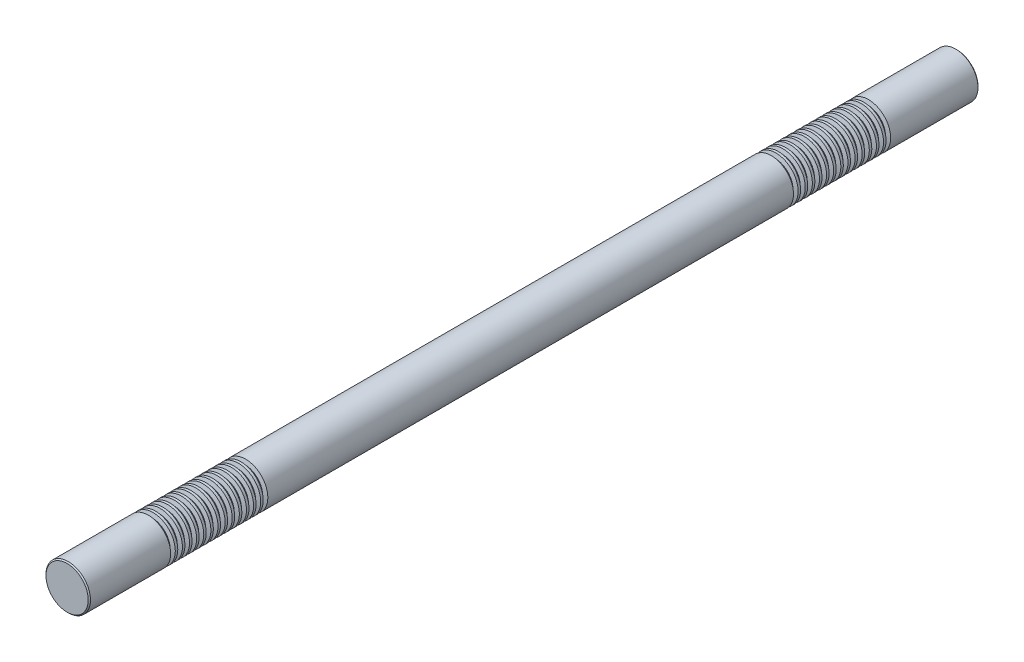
ISO-10303-21;
HEADER;
FILE_DESCRIPTION(('STEP AP214'),'2;1');
FILE_NAME('part.step','',(''),(''),'','','');
FILE_SCHEMA(('AUTOMOTIVE_DESIGN { 1 0 10303 214 1 1 1 1 }'));
ENDSEC;
DATA;
#1=APPLICATION_CONTEXT('core data for automotive mechanical design processes');
#2=APPLICATION_PROTOCOL_DEFINITION('international standard','automotive_design',2000,#1);
#3=PRODUCT_CONTEXT('',#1,'mechanical');
#4=PRODUCT('Part','Part','',(#3));
#5=PRODUCT_RELATED_PRODUCT_CATEGORY('part','',(#4));
#6=PRODUCT_DEFINITION_FORMATION('','',#4);
#7=PRODUCT_DEFINITION_CONTEXT('part definition',#1,'design');
#8=PRODUCT_DEFINITION('design','',#6,#7);
#9=PRODUCT_DEFINITION_SHAPE('','',#8);
#10=(LENGTH_UNIT() NAMED_UNIT(*) SI_UNIT(.MILLI.,.METRE.));
#11=(NAMED_UNIT(*) PLANE_ANGLE_UNIT() SI_UNIT($,.RADIAN.));
#12=(NAMED_UNIT(*) SI_UNIT($,.STERADIAN.) SOLID_ANGLE_UNIT());
#13=UNCERTAINTY_MEASURE_WITH_UNIT(LENGTH_MEASURE(1.E-05),#10,'distance_accuracy_value','');
#14=(GEOMETRIC_REPRESENTATION_CONTEXT(3) GLOBAL_UNCERTAINTY_ASSIGNED_CONTEXT((#13)) GLOBAL_UNIT_ASSIGNED_CONTEXT((#10,
#11,#12)) REPRESENTATION_CONTEXT('',''));
#15=CARTESIAN_POINT('',(0.,0.,0.));
#16=DIRECTION('',(0.,0.,1.));
#17=DIRECTION('',(1.,0.,0.));
#18=AXIS2_PLACEMENT_3D('',#15,#16,#17);
#19=CARTESIAN_POINT('',(0.,0.,500.));
#20=DIRECTION('',(0.,0.,-1.));
#21=DIRECTION('',(-1.,0.,0.));
#22=AXIS2_PLACEMENT_3D('',#19,#20,#21);
#23=CYLINDRICAL_SURFACE('',#22,25.);
#24=CARTESIAN_POINT('',(0.,0.,400.60288568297));
#25=DIRECTION('',(0.,0.,1.));
#26=DIRECTION('',(1.,0.,0.));
#27=AXIS2_PLACEMENT_3D('',#24,#25,#26);
#28=CIRCLE('',#27,25.);
#29=CARTESIAN_POINT('',(25.,0.,400.60288568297));
#30=VERTEX_POINT('',#29);
#31=EDGE_CURVE('E481',#30,#30,#28,.T.);
#32=ORIENTED_EDGE('',*,*,#31,.T.);
#33=EDGE_LOOP('',(#32));
#34=FACE_BOUND('',#33,.T.);
#35=CARTESIAN_POINT('',(0.,0.,403.39711431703));
#36=DIRECTION('',(0.,0.,1.));
#37=DIRECTION('',(1.,0.,0.));
#38=AXIS2_PLACEMENT_3D('',#35,#36,#37);
#39=CIRCLE('',#38,25.);
#40=CARTESIAN_POINT('',(25.,0.,403.39711431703));
#41=VERTEX_POINT('',#40);
#42=EDGE_CURVE('E493',#41,#41,#39,.T.);
#43=ORIENTED_EDGE('',*,*,#42,.F.);
#44=EDGE_LOOP('',(#43));
#45=FACE_BOUND('',#44,.T.);
#46=ADVANCED_FACE('F37',(#34,#45),#23,.T.);
#47=CARTESIAN_POINT('',(0.,0.,392.60288568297));
#48=DIRECTION('',(0.,0.,1.));
#49=DIRECTION('',(1.,0.,0.));
#50=AXIS2_PLACEMENT_3D('',#47,#48,#49);
#51=CIRCLE('',#50,25.);
#52=CARTESIAN_POINT('',(25.,0.,392.60288568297));
#53=VERTEX_POINT('',#52);
#54=EDGE_CURVE('E466',#53,#53,#51,.T.);
#55=ORIENTED_EDGE('',*,*,#54,.T.);
#56=EDGE_LOOP('',(#55));
#57=FACE_BOUND('',#56,.T.);
#58=CARTESIAN_POINT('',(0.,0.,395.39711431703));
#59=DIRECTION('',(0.,0.,1.));
#60=DIRECTION('',(1.,0.,0.));
#61=AXIS2_PLACEMENT_3D('',#58,#59,#60);
#62=CIRCLE('',#61,25.);
#63=CARTESIAN_POINT('',(25.,0.,395.39711431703));
#64=VERTEX_POINT('',#63);
#65=EDGE_CURVE('E477',#64,#64,#62,.T.);
#66=ORIENTED_EDGE('',*,*,#65,.F.);
#67=EDGE_LOOP('',(#66));
#68=FACE_BOUND('',#67,.T.);
#69=ADVANCED_FACE('F529',(#57,#68),#23,.T.);
#70=CARTESIAN_POINT('',(0.,0.,384.60288568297));
#71=DIRECTION('',(0.,0.,1.));
#72=DIRECTION('',(1.,0.,0.));
#73=AXIS2_PLACEMENT_3D('',#70,#71,#72);
#74=CIRCLE('',#73,25.);
#75=CARTESIAN_POINT('',(25.,0.,384.60288568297));
#76=VERTEX_POINT('',#75);
#77=EDGE_CURVE('E451',#76,#76,#74,.T.);
#78=ORIENTED_EDGE('',*,*,#77,.T.);
#79=EDGE_LOOP('',(#78));
#80=FACE_BOUND('',#79,.T.);
#81=CARTESIAN_POINT('',(0.,0.,387.39711431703));
#82=DIRECTION('',(0.,0.,1.));
#83=DIRECTION('',(1.,0.,0.));
#84=AXIS2_PLACEMENT_3D('',#81,#82,#83);
#85=CIRCLE('',#84,25.);
#86=CARTESIAN_POINT('',(25.,0.,387.39711431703));
#87=VERTEX_POINT('',#86);
#88=EDGE_CURVE('E462',#87,#87,#85,.T.);
#89=ORIENTED_EDGE('',*,*,#88,.F.);
#90=EDGE_LOOP('',(#89));
#91=FACE_BOUND('',#90,.T.);
#92=ADVANCED_FACE('F537',(#80,#91),#23,.T.);
#93=CARTESIAN_POINT('',(0.,0.,376.60288568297));
#94=DIRECTION('',(0.,0.,1.));
#95=DIRECTION('',(1.,0.,0.));
#96=AXIS2_PLACEMENT_3D('',#93,#94,#95);
#97=CIRCLE('',#96,25.);
#98=CARTESIAN_POINT('',(25.,0.,376.60288568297));
#99=VERTEX_POINT('',#98);
#100=EDGE_CURVE('E435',#99,#99,#97,.T.);
#101=ORIENTED_EDGE('',*,*,#100,.T.);
#102=EDGE_LOOP('',(#101));
#103=FACE_BOUND('',#102,.T.);
#104=CARTESIAN_POINT('',(0.,0.,379.39711431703));
#105=DIRECTION('',(0.,0.,1.));
#106=DIRECTION('',(1.,0.,0.));
#107=AXIS2_PLACEMENT_3D('',#104,#105,#106);
#108=CIRCLE('',#107,25.);
#109=CARTESIAN_POINT('',(25.,0.,379.39711431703));
#110=VERTEX_POINT('',#109);
#111=EDGE_CURVE('E447',#110,#110,#108,.T.);
#112=ORIENTED_EDGE('',*,*,#111,.F.);
#113=EDGE_LOOP('',(#112));
#114=FACE_BOUND('',#113,.T.);
#115=ADVANCED_FACE('F1082',(#103,#114),#23,.T.);
#116=CARTESIAN_POINT('',(0.,0.,368.60288568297));
#117=DIRECTION('',(0.,0.,1.));
#118=DIRECTION('',(1.,0.,0.));
#119=AXIS2_PLACEMENT_3D('',#116,#117,#118);
#120=CIRCLE('',#119,25.);
#121=CARTESIAN_POINT('',(25.,0.,368.60288568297));
#122=VERTEX_POINT('',#121);
#123=EDGE_CURVE('E419',#122,#122,#120,.T.);
#124=ORIENTED_EDGE('',*,*,#123,.T.);
#125=EDGE_LOOP('',(#124));
#126=FACE_BOUND('',#125,.T.);
#127=CARTESIAN_POINT('',(0.,0.,371.39711431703));
#128=DIRECTION('',(0.,0.,1.));
#129=DIRECTION('',(1.,0.,0.));
#130=AXIS2_PLACEMENT_3D('',#127,#128,#129);
#131=CIRCLE('',#130,25.);
#132=CARTESIAN_POINT('',(25.,0.,371.39711431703));
#133=VERTEX_POINT('',#132);
#134=EDGE_CURVE('E431',#133,#133,#131,.T.);
#135=ORIENTED_EDGE('',*,*,#134,.F.);
#136=EDGE_LOOP('',(#135));
#137=FACE_BOUND('',#136,.T.);
#138=ADVANCED_FACE('F1059',(#126,#137),#23,.T.);
#139=CARTESIAN_POINT('',(0.,0.,360.60288568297));
#140=DIRECTION('',(0.,0.,1.));
#141=DIRECTION('',(1.,0.,0.));
#142=AXIS2_PLACEMENT_3D('',#139,#140,#141);
#143=CIRCLE('',#142,25.);
#144=CARTESIAN_POINT('',(25.,0.,360.60288568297));
#145=VERTEX_POINT('',#144);
#146=EDGE_CURVE('E403',#145,#145,#143,.T.);
#147=ORIENTED_EDGE('',*,*,#146,.T.);
#148=EDGE_LOOP('',(#147));
#149=FACE_BOUND('',#148,.T.);
#150=CARTESIAN_POINT('',(0.,0.,363.39711431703));
#151=DIRECTION('',(0.,0.,1.));
#152=DIRECTION('',(1.,0.,0.));
#153=AXIS2_PLACEMENT_3D('',#150,#151,#152);
#154=CIRCLE('',#153,25.);
#155=CARTESIAN_POINT('',(25.,0.,363.39711431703));
#156=VERTEX_POINT('',#155);
#157=EDGE_CURVE('E415',#156,#156,#154,.T.);
#158=ORIENTED_EDGE('',*,*,#157,.F.);
#159=EDGE_LOOP('',(#158));
#160=FACE_BOUND('',#159,.T.);
#161=ADVANCED_FACE('F1036',(#149,#160),#23,.T.);
#162=CARTESIAN_POINT('',(0.,0.,352.60288568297));
#163=DIRECTION('',(0.,0.,1.));
#164=DIRECTION('',(1.,0.,0.));
#165=AXIS2_PLACEMENT_3D('',#162,#163,#164);
#166=CIRCLE('',#165,25.);
#167=CARTESIAN_POINT('',(25.,0.,352.60288568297));
#168=VERTEX_POINT('',#167);
#169=EDGE_CURVE('E387',#168,#168,#166,.T.);
#170=ORIENTED_EDGE('',*,*,#169,.T.);
#171=EDGE_LOOP('',(#170));
#172=FACE_BOUND('',#171,.T.);
#173=CARTESIAN_POINT('',(0.,0.,355.39711431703));
#174=DIRECTION('',(0.,0.,1.));
#175=DIRECTION('',(1.,0.,0.));
#176=AXIS2_PLACEMENT_3D('',#173,#174,#175);
#177=CIRCLE('',#176,25.);
#178=CARTESIAN_POINT('',(25.,0.,355.39711431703));
#179=VERTEX_POINT('',#178);
#180=EDGE_CURVE('E399',#179,#179,#177,.T.);
#181=ORIENTED_EDGE('',*,*,#180,.F.);
#182=EDGE_LOOP('',(#181));
#183=FACE_BOUND('',#182,.T.);
#184=ADVANCED_FACE('F1013',(#172,#183),#23,.T.);
#185=CARTESIAN_POINT('',(0.,0.,344.60288568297));
#186=DIRECTION('',(0.,0.,1.));
#187=DIRECTION('',(1.,0.,0.));
#188=AXIS2_PLACEMENT_3D('',#185,#186,#187);
#189=CIRCLE('',#188,25.);
#190=CARTESIAN_POINT('',(25.,0.,344.60288568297));
#191=VERTEX_POINT('',#190);
#192=EDGE_CURVE('E371',#191,#191,#189,.T.);
#193=ORIENTED_EDGE('',*,*,#192,.T.);
#194=EDGE_LOOP('',(#193));
#195=FACE_BOUND('',#194,.T.);
#196=CARTESIAN_POINT('',(0.,0.,347.39711431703));
#197=DIRECTION('',(0.,0.,1.));
#198=DIRECTION('',(1.,0.,0.));
#199=AXIS2_PLACEMENT_3D('',#196,#197,#198);
#200=CIRCLE('',#199,25.);
#201=CARTESIAN_POINT('',(25.,0.,347.39711431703));
#202=VERTEX_POINT('',#201);
#203=EDGE_CURVE('E383',#202,#202,#200,.T.);
#204=ORIENTED_EDGE('',*,*,#203,.F.);
#205=EDGE_LOOP('',(#204));
#206=FACE_BOUND('',#205,.T.);
#207=ADVANCED_FACE('F990',(#195,#206),#23,.T.);
#208=CARTESIAN_POINT('',(0.,0.,336.60288568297));
#209=DIRECTION('',(0.,0.,1.));
#210=DIRECTION('',(1.,0.,0.));
#211=AXIS2_PLACEMENT_3D('',#208,#209,#210);
#212=CIRCLE('',#211,25.);
#213=CARTESIAN_POINT('',(25.,0.,336.60288568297));
#214=VERTEX_POINT('',#213);
#215=EDGE_CURVE('E355',#214,#214,#212,.T.);
#216=ORIENTED_EDGE('',*,*,#215,.T.);
#217=EDGE_LOOP('',(#216));
#218=FACE_BOUND('',#217,.T.);
#219=CARTESIAN_POINT('',(0.,0.,339.39711431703));
#220=DIRECTION('',(0.,0.,1.));
#221=DIRECTION('',(1.,0.,0.));
#222=AXIS2_PLACEMENT_3D('',#219,#220,#221);
#223=CIRCLE('',#222,25.);
#224=CARTESIAN_POINT('',(25.,0.,339.39711431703));
#225=VERTEX_POINT('',#224);
#226=EDGE_CURVE('E367',#225,#225,#223,.T.);
#227=ORIENTED_EDGE('',*,*,#226,.F.);
#228=EDGE_LOOP('',(#227));
#229=FACE_BOUND('',#228,.T.);
#230=ADVANCED_FACE('F967',(#218,#229),#23,.T.);
#231=CARTESIAN_POINT('',(0.,0.,328.60288568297));
#232=DIRECTION('',(0.,0.,1.));
#233=DIRECTION('',(1.,0.,0.));
#234=AXIS2_PLACEMENT_3D('',#231,#232,#233);
#235=CIRCLE('',#234,25.);
#236=CARTESIAN_POINT('',(25.,0.,328.60288568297));
#237=VERTEX_POINT('',#236);
#238=EDGE_CURVE('E339',#237,#237,#235,.T.);
#239=ORIENTED_EDGE('',*,*,#238,.T.);
#240=EDGE_LOOP('',(#239));
#241=FACE_BOUND('',#240,.T.);
#242=CARTESIAN_POINT('',(0.,0.,331.39711431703));
#243=DIRECTION('',(0.,0.,1.));
#244=DIRECTION('',(1.,0.,0.));
#245=AXIS2_PLACEMENT_3D('',#242,#243,#244);
#246=CIRCLE('',#245,25.);
#247=CARTESIAN_POINT('',(25.,0.,331.39711431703));
#248=VERTEX_POINT('',#247);
#249=EDGE_CURVE('E351',#248,#248,#246,.T.);
#250=ORIENTED_EDGE('',*,*,#249,.F.);
#251=EDGE_LOOP('',(#250));
#252=FACE_BOUND('',#251,.T.);
#253=ADVANCED_FACE('F944',(#241,#252),#23,.T.);
#254=CARTESIAN_POINT('',(0.,0.,320.60288568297));
#255=DIRECTION('',(0.,0.,1.));
#256=DIRECTION('',(1.,0.,0.));
#257=AXIS2_PLACEMENT_3D('',#254,#255,#256);
#258=CIRCLE('',#257,25.);
#259=CARTESIAN_POINT('',(25.,0.,320.60288568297));
#260=VERTEX_POINT('',#259);
#261=EDGE_CURVE('E323',#260,#260,#258,.T.);
#262=ORIENTED_EDGE('',*,*,#261,.T.);
#263=EDGE_LOOP('',(#262));
#264=FACE_BOUND('',#263,.T.);
#265=CARTESIAN_POINT('',(0.,0.,323.39711431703));
#266=DIRECTION('',(0.,0.,1.));
#267=DIRECTION('',(1.,0.,0.));
#268=AXIS2_PLACEMENT_3D('',#265,#266,#267);
#269=CIRCLE('',#268,25.);
#270=CARTESIAN_POINT('',(25.,0.,323.39711431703));
#271=VERTEX_POINT('',#270);
#272=EDGE_CURVE('E335',#271,#271,#269,.T.);
#273=ORIENTED_EDGE('',*,*,#272,.F.);
#274=EDGE_LOOP('',(#273));
#275=FACE_BOUND('',#274,.T.);
#276=ADVANCED_FACE('F921',(#264,#275),#23,.T.);
#277=CARTESIAN_POINT('',(0.,0.,312.60288568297));
#278=DIRECTION('',(0.,0.,1.));
#279=DIRECTION('',(1.,0.,0.));
#280=AXIS2_PLACEMENT_3D('',#277,#278,#279);
#281=CIRCLE('',#280,25.);
#282=CARTESIAN_POINT('',(25.,0.,312.60288568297));
#283=VERTEX_POINT('',#282);
#284=EDGE_CURVE('E307',#283,#283,#281,.T.);
#285=ORIENTED_EDGE('',*,*,#284,.T.);
#286=EDGE_LOOP('',(#285));
#287=FACE_BOUND('',#286,.T.);
#288=CARTESIAN_POINT('',(0.,0.,315.39711431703));
#289=DIRECTION('',(0.,0.,1.));
#290=DIRECTION('',(1.,0.,0.));
#291=AXIS2_PLACEMENT_3D('',#288,#289,#290);
#292=CIRCLE('',#291,25.);
#293=CARTESIAN_POINT('',(25.,0.,315.39711431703));
#294=VERTEX_POINT('',#293);
#295=EDGE_CURVE('E319',#294,#294,#292,.T.);
#296=ORIENTED_EDGE('',*,*,#295,.F.);
#297=EDGE_LOOP('',(#296));
#298=FACE_BOUND('',#297,.T.);
#299=ADVANCED_FACE('F898',(#287,#298),#23,.T.);
#300=CARTESIAN_POINT('',(0.,0.,304.60288568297));
#301=DIRECTION('',(0.,0.,1.));
#302=DIRECTION('',(1.,0.,0.));
#303=AXIS2_PLACEMENT_3D('',#300,#301,#302);
#304=CIRCLE('',#303,25.);
#305=CARTESIAN_POINT('',(25.,0.,304.60288568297));
#306=VERTEX_POINT('',#305);
#307=EDGE_CURVE('E291',#306,#306,#304,.T.);
#308=ORIENTED_EDGE('',*,*,#307,.T.);
#309=EDGE_LOOP('',(#308));
#310=FACE_BOUND('',#309,.T.);
#311=CARTESIAN_POINT('',(0.,0.,307.39711431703));
#312=DIRECTION('',(0.,0.,1.));
#313=DIRECTION('',(1.,0.,0.));
#314=AXIS2_PLACEMENT_3D('',#311,#312,#313);
#315=CIRCLE('',#314,25.);
#316=CARTESIAN_POINT('',(25.,0.,307.39711431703));
#317=VERTEX_POINT('',#316);
#318=EDGE_CURVE('E303',#317,#317,#315,.T.);
#319=ORIENTED_EDGE('',*,*,#318,.F.);
#320=EDGE_LOOP('',(#319));
#321=FACE_BOUND('',#320,.T.);
#322=ADVANCED_FACE('F875',(#310,#321),#23,.T.);
#323=CARTESIAN_POINT('',(0.,0.,-291.39711431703));
#324=DIRECTION('',(0.,0.,1.));
#325=DIRECTION('',(1.,0.,0.));
#326=AXIS2_PLACEMENT_3D('',#323,#324,#325);
#327=CIRCLE('',#326,25.);
#328=CARTESIAN_POINT('',(25.,0.,-291.39711431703));
#329=VERTEX_POINT('',#328);
#330=EDGE_CURVE('E275',#329,#329,#327,.T.);
#331=ORIENTED_EDGE('',*,*,#330,.T.);
#332=EDGE_LOOP('',(#331));
#333=FACE_BOUND('',#332,.T.);
#334=CARTESIAN_POINT('',(0.,0.,299.39711431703));
#335=DIRECTION('',(0.,0.,1.));
#336=DIRECTION('',(1.,0.,0.));
#337=AXIS2_PLACEMENT_3D('',#334,#335,#336);
#338=CIRCLE('',#337,25.);
#339=CARTESIAN_POINT('',(25.,0.,299.39711431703));
#340=VERTEX_POINT('',#339);
#341=EDGE_CURVE('E287',#340,#340,#338,.T.);
#342=ORIENTED_EDGE('',*,*,#341,.F.);
#343=EDGE_LOOP('',(#342));
#344=FACE_BOUND('',#343,.T.);
#345=ADVANCED_FACE('F852',(#333,#344),#23,.T.);
#346=CARTESIAN_POINT('',(0.,0.,-299.39711431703));
#347=DIRECTION('',(0.,0.,1.));
#348=DIRECTION('',(1.,0.,0.));
#349=AXIS2_PLACEMENT_3D('',#346,#347,#348);
#350=CIRCLE('',#349,25.);
#351=CARTESIAN_POINT('',(25.,0.,-299.39711431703));
#352=VERTEX_POINT('',#351);
#353=EDGE_CURVE('E259',#352,#352,#350,.T.);
#354=ORIENTED_EDGE('',*,*,#353,.T.);
#355=EDGE_LOOP('',(#354));
#356=FACE_BOUND('',#355,.T.);
#357=CARTESIAN_POINT('',(0.,0.,-296.60288568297));
#358=DIRECTION('',(0.,0.,1.));
#359=DIRECTION('',(1.,0.,0.));
#360=AXIS2_PLACEMENT_3D('',#357,#358,#359);
#361=CIRCLE('',#360,25.);
#362=CARTESIAN_POINT('',(25.,0.,-296.60288568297));
#363=VERTEX_POINT('',#362);
#364=EDGE_CURVE('E271',#363,#363,#361,.T.);
#365=ORIENTED_EDGE('',*,*,#364,.F.);
#366=EDGE_LOOP('',(#365));
#367=FACE_BOUND('',#366,.T.);
#368=ADVANCED_FACE('F829',(#356,#367),#23,.T.);
#369=CARTESIAN_POINT('',(0.,0.,-307.39711431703));
#370=DIRECTION('',(0.,0.,1.));
#371=DIRECTION('',(1.,0.,0.));
#372=AXIS2_PLACEMENT_3D('',#369,#370,#371);
#373=CIRCLE('',#372,25.);
#374=CARTESIAN_POINT('',(25.,0.,-307.39711431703));
#375=VERTEX_POINT('',#374);
#376=EDGE_CURVE('E243',#375,#375,#373,.T.);
#377=ORIENTED_EDGE('',*,*,#376,.T.);
#378=EDGE_LOOP('',(#377));
#379=FACE_BOUND('',#378,.T.);
#380=CARTESIAN_POINT('',(0.,0.,-304.60288568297));
#381=DIRECTION('',(0.,0.,1.));
#382=DIRECTION('',(1.,0.,0.));
#383=AXIS2_PLACEMENT_3D('',#380,#381,#382);
#384=CIRCLE('',#383,25.);
#385=CARTESIAN_POINT('',(25.,0.,-304.60288568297));
#386=VERTEX_POINT('',#385);
#387=EDGE_CURVE('E255',#386,#386,#384,.T.);
#388=ORIENTED_EDGE('',*,*,#387,.F.);
#389=EDGE_LOOP('',(#388));
#390=FACE_BOUND('',#389,.T.);
#391=ADVANCED_FACE('F806',(#379,#390),#23,.T.);
#392=CARTESIAN_POINT('',(0.,0.,-315.39711431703));
#393=DIRECTION('',(0.,0.,1.));
#394=DIRECTION('',(1.,0.,0.));
#395=AXIS2_PLACEMENT_3D('',#392,#393,#394);
#396=CIRCLE('',#395,25.);
#397=CARTESIAN_POINT('',(25.,0.,-315.39711431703));
#398=VERTEX_POINT('',#397);
#399=EDGE_CURVE('E227',#398,#398,#396,.T.);
#400=ORIENTED_EDGE('',*,*,#399,.T.);
#401=EDGE_LOOP('',(#400));
#402=FACE_BOUND('',#401,.T.);
#403=CARTESIAN_POINT('',(0.,0.,-312.60288568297));
#404=DIRECTION('',(0.,0.,1.));
#405=DIRECTION('',(1.,0.,0.));
#406=AXIS2_PLACEMENT_3D('',#403,#404,#405);
#407=CIRCLE('',#406,25.);
#408=CARTESIAN_POINT('',(25.,0.,-312.60288568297));
#409=VERTEX_POINT('',#408);
#410=EDGE_CURVE('E239',#409,#409,#407,.T.);
#411=ORIENTED_EDGE('',*,*,#410,.F.);
#412=EDGE_LOOP('',(#411));
#413=FACE_BOUND('',#412,.T.);
#414=ADVANCED_FACE('F783',(#402,#413),#23,.T.);
#415=CARTESIAN_POINT('',(0.,0.,-323.39711431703));
#416=DIRECTION('',(0.,0.,1.));
#417=DIRECTION('',(1.,0.,0.));
#418=AXIS2_PLACEMENT_3D('',#415,#416,#417);
#419=CIRCLE('',#418,25.);
#420=CARTESIAN_POINT('',(25.,0.,-323.39711431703));
#421=VERTEX_POINT('',#420);
#422=EDGE_CURVE('E211',#421,#421,#419,.T.);
#423=ORIENTED_EDGE('',*,*,#422,.T.);
#424=EDGE_LOOP('',(#423));
#425=FACE_BOUND('',#424,.T.);
#426=CARTESIAN_POINT('',(0.,0.,-320.60288568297));
#427=DIRECTION('',(0.,0.,1.));
#428=DIRECTION('',(1.,0.,0.));
#429=AXIS2_PLACEMENT_3D('',#426,#427,#428);
#430=CIRCLE('',#429,25.);
#431=CARTESIAN_POINT('',(25.,0.,-320.60288568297));
#432=VERTEX_POINT('',#431);
#433=EDGE_CURVE('E223',#432,#432,#430,.T.);
#434=ORIENTED_EDGE('',*,*,#433,.F.);
#435=EDGE_LOOP('',(#434));
#436=FACE_BOUND('',#435,.T.);
#437=ADVANCED_FACE('F760',(#425,#436),#23,.T.);
#438=CARTESIAN_POINT('',(0.,0.,-331.39711431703));
#439=DIRECTION('',(0.,0.,1.));
#440=DIRECTION('',(1.,0.,0.));
#441=AXIS2_PLACEMENT_3D('',#438,#439,#440);
#442=CIRCLE('',#441,25.);
#443=CARTESIAN_POINT('',(25.,0.,-331.39711431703));
#444=VERTEX_POINT('',#443);
#445=EDGE_CURVE('E195',#444,#444,#442,.T.);
#446=ORIENTED_EDGE('',*,*,#445,.T.);
#447=EDGE_LOOP('',(#446));
#448=FACE_BOUND('',#447,.T.);
#449=CARTESIAN_POINT('',(0.,0.,-328.60288568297));
#450=DIRECTION('',(0.,0.,1.));
#451=DIRECTION('',(1.,0.,0.));
#452=AXIS2_PLACEMENT_3D('',#449,#450,#451);
#453=CIRCLE('',#452,25.);
#454=CARTESIAN_POINT('',(25.,0.,-328.60288568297));
#455=VERTEX_POINT('',#454);
#456=EDGE_CURVE('E207',#455,#455,#453,.T.);
#457=ORIENTED_EDGE('',*,*,#456,.F.);
#458=EDGE_LOOP('',(#457));
#459=FACE_BOUND('',#458,.T.);
#460=ADVANCED_FACE('F737',(#448,#459),#23,.T.);
#461=CARTESIAN_POINT('',(0.,0.,-339.39711431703));
#462=DIRECTION('',(0.,0.,1.));
#463=DIRECTION('',(1.,0.,0.));
#464=AXIS2_PLACEMENT_3D('',#461,#462,#463);
#465=CIRCLE('',#464,25.);
#466=CARTESIAN_POINT('',(25.,0.,-339.39711431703));
#467=VERTEX_POINT('',#466);
#468=EDGE_CURVE('E179',#467,#467,#465,.T.);
#469=ORIENTED_EDGE('',*,*,#468,.T.);
#470=EDGE_LOOP('',(#469));
#471=FACE_BOUND('',#470,.T.);
#472=CARTESIAN_POINT('',(0.,0.,-336.60288568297));
#473=DIRECTION('',(0.,0.,1.));
#474=DIRECTION('',(1.,0.,0.));
#475=AXIS2_PLACEMENT_3D('',#472,#473,#474);
#476=CIRCLE('',#475,25.);
#477=CARTESIAN_POINT('',(25.,0.,-336.60288568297));
#478=VERTEX_POINT('',#477);
#479=EDGE_CURVE('E191',#478,#478,#476,.T.);
#480=ORIENTED_EDGE('',*,*,#479,.F.);
#481=EDGE_LOOP('',(#480));
#482=FACE_BOUND('',#481,.T.);
#483=ADVANCED_FACE('F714',(#471,#482),#23,.T.);
#484=CARTESIAN_POINT('',(0.,0.,-347.39711431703));
#485=DIRECTION('',(0.,0.,1.));
#486=DIRECTION('',(1.,0.,0.));
#487=AXIS2_PLACEMENT_3D('',#484,#485,#486);
#488=CIRCLE('',#487,25.);
#489=CARTESIAN_POINT('',(25.,0.,-347.39711431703));
#490=VERTEX_POINT('',#489);
#491=EDGE_CURVE('E163',#490,#490,#488,.T.);
#492=ORIENTED_EDGE('',*,*,#491,.T.);
#493=EDGE_LOOP('',(#492));
#494=FACE_BOUND('',#493,.T.);
#495=CARTESIAN_POINT('',(0.,0.,-344.60288568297));
#496=DIRECTION('',(0.,0.,1.));
#497=DIRECTION('',(1.,0.,0.));
#498=AXIS2_PLACEMENT_3D('',#495,#496,#497);
#499=CIRCLE('',#498,25.);
#500=CARTESIAN_POINT('',(25.,0.,-344.60288568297));
#501=VERTEX_POINT('',#500);
#502=EDGE_CURVE('E175',#501,#501,#499,.T.);
#503=ORIENTED_EDGE('',*,*,#502,.F.);
#504=EDGE_LOOP('',(#503));
#505=FACE_BOUND('',#504,.T.);
#506=ADVANCED_FACE('F691',(#494,#505),#23,.T.);
#507=CARTESIAN_POINT('',(0.,0.,-355.39711431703));
#508=DIRECTION('',(0.,0.,1.));
#509=DIRECTION('',(1.,0.,0.));
#510=AXIS2_PLACEMENT_3D('',#507,#508,#509);
#511=CIRCLE('',#510,25.);
#512=CARTESIAN_POINT('',(25.,0.,-355.39711431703));
#513=VERTEX_POINT('',#512);
#514=EDGE_CURVE('E147',#513,#513,#511,.T.);
#515=ORIENTED_EDGE('',*,*,#514,.T.);
#516=EDGE_LOOP('',(#515));
#517=FACE_BOUND('',#516,.T.);
#518=CARTESIAN_POINT('',(0.,0.,-352.60288568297));
#519=DIRECTION('',(0.,0.,1.));
#520=DIRECTION('',(1.,0.,0.));
#521=AXIS2_PLACEMENT_3D('',#518,#519,#520);
#522=CIRCLE('',#521,25.);
#523=CARTESIAN_POINT('',(25.,0.,-352.60288568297));
#524=VERTEX_POINT('',#523);
#525=EDGE_CURVE('E159',#524,#524,#522,.T.);
#526=ORIENTED_EDGE('',*,*,#525,.F.);
#527=EDGE_LOOP('',(#526));
#528=FACE_BOUND('',#527,.T.);
#529=ADVANCED_FACE('F668',(#517,#528),#23,.T.);
#530=CARTESIAN_POINT('',(0.,0.,-363.39711431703));
#531=DIRECTION('',(0.,0.,1.));
#532=DIRECTION('',(1.,0.,0.));
#533=AXIS2_PLACEMENT_3D('',#530,#531,#532);
#534=CIRCLE('',#533,25.);
#535=CARTESIAN_POINT('',(25.,0.,-363.39711431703));
#536=VERTEX_POINT('',#535);
#537=EDGE_CURVE('E132',#536,#536,#534,.T.);
#538=ORIENTED_EDGE('',*,*,#537,.T.);
#539=EDGE_LOOP('',(#538));
#540=FACE_BOUND('',#539,.T.);
#541=CARTESIAN_POINT('',(0.,0.,-360.60288568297));
#542=DIRECTION('',(0.,0.,1.));
#543=DIRECTION('',(1.,0.,0.));
#544=AXIS2_PLACEMENT_3D('',#541,#542,#543);
#545=CIRCLE('',#544,25.);
#546=CARTESIAN_POINT('',(25.,0.,-360.60288568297));
#547=VERTEX_POINT('',#546);
#548=EDGE_CURVE('E143',#547,#547,#545,.T.);
#549=ORIENTED_EDGE('',*,*,#548,.F.);
#550=EDGE_LOOP('',(#549));
#551=FACE_BOUND('',#550,.T.);
#552=ADVANCED_FACE('F645',(#540,#551),#23,.T.);
#553=CARTESIAN_POINT('',(0.,0.,-371.39711431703));
#554=DIRECTION('',(0.,0.,1.));
#555=DIRECTION('',(1.,0.,0.));
#556=AXIS2_PLACEMENT_3D('',#553,#554,#555);
#557=CIRCLE('',#556,25.);
#558=CARTESIAN_POINT('',(25.,0.,-371.39711431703));
#559=VERTEX_POINT('',#558);
#560=EDGE_CURVE('E116',#559,#559,#557,.T.);
#561=ORIENTED_EDGE('',*,*,#560,.T.);
#562=EDGE_LOOP('',(#561));
#563=FACE_BOUND('',#562,.T.);
#564=CARTESIAN_POINT('',(0.,0.,-368.60288568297));
#565=DIRECTION('',(0.,0.,1.));
#566=DIRECTION('',(1.,0.,0.));
#567=AXIS2_PLACEMENT_3D('',#564,#565,#566);
#568=CIRCLE('',#567,25.);
#569=CARTESIAN_POINT('',(25.,0.,-368.60288568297));
#570=VERTEX_POINT('',#569);
#571=EDGE_CURVE('E128',#570,#570,#568,.T.);
#572=ORIENTED_EDGE('',*,*,#571,.F.);
#573=EDGE_LOOP('',(#572));
#574=FACE_BOUND('',#573,.T.);
#575=ADVANCED_FACE('F622',(#563,#574),#23,.T.);
#576=CARTESIAN_POINT('',(0.,0.,-379.39711431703));
#577=DIRECTION('',(0.,0.,1.));
#578=DIRECTION('',(1.,0.,0.));
#579=AXIS2_PLACEMENT_3D('',#576,#577,#578);
#580=CIRCLE('',#579,25.);
#581=CARTESIAN_POINT('',(25.,0.,-379.39711431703));
#582=VERTEX_POINT('',#581);
#583=EDGE_CURVE('E101',#582,#582,#580,.T.);
#584=ORIENTED_EDGE('',*,*,#583,.T.);
#585=EDGE_LOOP('',(#584));
#586=FACE_BOUND('',#585,.T.);
#587=CARTESIAN_POINT('',(0.,0.,-376.60288568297));
#588=DIRECTION('',(0.,0.,1.));
#589=DIRECTION('',(1.,0.,0.));
#590=AXIS2_PLACEMENT_3D('',#587,#588,#589);
#591=CIRCLE('',#590,25.);
#592=CARTESIAN_POINT('',(25.,0.,-376.60288568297));
#593=VERTEX_POINT('',#592);
#594=EDGE_CURVE('E112',#593,#593,#591,.T.);
#595=ORIENTED_EDGE('',*,*,#594,.F.);
#596=EDGE_LOOP('',(#595));
#597=FACE_BOUND('',#596,.T.);
#598=ADVANCED_FACE('F599',(#586,#597),#23,.T.);
#599=CARTESIAN_POINT('',(0.,0.,-387.39711431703));
#600=DIRECTION('',(0.,0.,1.));
#601=DIRECTION('',(1.,0.,0.));
#602=AXIS2_PLACEMENT_3D('',#599,#600,#601);
#603=CIRCLE('',#602,25.);
#604=CARTESIAN_POINT('',(25.,0.,-387.39711431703));
#605=VERTEX_POINT('',#604);
#606=EDGE_CURVE('E85',#605,#605,#603,.T.);
#607=ORIENTED_EDGE('',*,*,#606,.T.);
#608=EDGE_LOOP('',(#607));
#609=FACE_BOUND('',#608,.T.);
#610=CARTESIAN_POINT('',(0.,0.,-384.60288568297));
#611=DIRECTION('',(0.,0.,1.));
#612=DIRECTION('',(1.,0.,0.));
#613=AXIS2_PLACEMENT_3D('',#610,#611,#612);
#614=CIRCLE('',#613,25.);
#615=CARTESIAN_POINT('',(25.,0.,-384.60288568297));
#616=VERTEX_POINT('',#615);
#617=EDGE_CURVE('E97',#616,#616,#614,.T.);
#618=ORIENTED_EDGE('',*,*,#617,.F.);
#619=EDGE_LOOP('',(#618));
#620=FACE_BOUND('',#619,.T.);
#621=ADVANCED_FACE('F552',(#609,#620),#23,.T.);
#622=CARTESIAN_POINT('',(0.,0.,-395.39711431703));
#623=DIRECTION('',(0.,0.,1.));
#624=DIRECTION('',(1.,0.,0.));
#625=AXIS2_PLACEMENT_3D('',#622,#623,#624);
#626=CIRCLE('',#625,25.);
#627=CARTESIAN_POINT('',(25.,0.,-395.39711431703));
#628=VERTEX_POINT('',#627);
#629=EDGE_CURVE('E69',#628,#628,#626,.T.);
#630=ORIENTED_EDGE('',*,*,#629,.T.);
#631=EDGE_LOOP('',(#630));
#632=FACE_BOUND('',#631,.T.);
#633=CARTESIAN_POINT('',(0.,0.,-392.60288568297));
#634=DIRECTION('',(0.,0.,1.));
#635=DIRECTION('',(1.,0.,0.));
#636=AXIS2_PLACEMENT_3D('',#633,#634,#635);
#637=CIRCLE('',#636,25.);
#638=CARTESIAN_POINT('',(25.,0.,-392.60288568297));
#639=VERTEX_POINT('',#638);
#640=EDGE_CURVE('E81',#639,#639,#637,.T.);
#641=ORIENTED_EDGE('',*,*,#640,.F.);
#642=EDGE_LOOP('',(#641));
#643=FACE_BOUND('',#642,.T.);
#644=ADVANCED_FACE('F545',(#632,#643),#23,.T.);
#645=CARTESIAN_POINT('',(0.,0.,-498.75));
#646=DIRECTION('',(0.,0.,1.));
#647=DIRECTION('',(1.,0.,0.));
#648=AXIS2_PLACEMENT_3D('',#645,#646,#647);
#649=CIRCLE('',#648,25.);
#650=CARTESIAN_POINT('',(25.,0.,-498.75));
#651=VERTEX_POINT('',#650);
#652=EDGE_CURVE('E52',#651,#651,#649,.T.);
#653=ORIENTED_EDGE('',*,*,#652,.T.);
#654=EDGE_LOOP('',(#653));
#655=FACE_BOUND('',#654,.T.);
#656=CARTESIAN_POINT('',(0.,0.,-400.60288568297));
#657=DIRECTION('',(0.,0.,1.));
#658=DIRECTION('',(1.,0.,0.));
#659=AXIS2_PLACEMENT_3D('',#656,#657,#658);
#660=CIRCLE('',#659,25.);
#661=CARTESIAN_POINT('',(25.,0.,-400.60288568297));
#662=VERTEX_POINT('',#661);
#663=EDGE_CURVE('E65',#662,#662,#660,.T.);
#664=ORIENTED_EDGE('',*,*,#663,.F.);
#665=EDGE_LOOP('',(#664));
#666=FACE_BOUND('',#665,.T.);
#667=ADVANCED_FACE('F533',(#655,#666),#23,.T.);
#668=CARTESIAN_POINT('',(0.,0.,-500.));
#669=DIRECTION('',(0.,0.,1.));
#670=DIRECTION('',(1.,0.,0.));
#671=AXIS2_PLACEMENT_3D('',#668,#669,#670);
#672=PLANE('',#671);
#673=CARTESIAN_POINT('',(0.,0.,-500.));
#674=DIRECTION('',(0.,0.,1.));
#675=DIRECTION('',(1.,0.,0.));
#676=AXIS2_PLACEMENT_3D('',#673,#674,#675);
#677=CIRCLE('',#676,23.7500000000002);
#678=CARTESIAN_POINT('',(23.7500000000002,0.,-500.));
#679=VERTEX_POINT('',#678);
#680=EDGE_CURVE('E45',#679,#679,#677,.F.);
#681=ORIENTED_EDGE('',*,*,#680,.T.);
#682=EDGE_LOOP('',(#681));
#683=FACE_BOUND('',#682,.T.);
#684=ADVANCED_FACE('F544',(#683),#672,.F.);
#685=CARTESIAN_POINT('',(0.,0.,-498.75));
#686=DIRECTION('',(0.,0.,1.));
#687=DIRECTION('',(1.,0.,0.));
#688=AXIS2_PLACEMENT_3D('',#685,#686,#687);
#689=CONICAL_SURFACE('',#688,25.,0.785398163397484);
#690=ORIENTED_EDGE('',*,*,#680,.F.);
#691=EDGE_LOOP('',(#690));
#692=FACE_BOUND('',#691,.T.);
#693=ORIENTED_EDGE('',*,*,#652,.F.);
#694=EDGE_LOOP('',(#693));
#695=FACE_BOUND('',#694,.T.);
#696=ADVANCED_FACE('F551',(#692,#695),#689,.T.);
#697=CARTESIAN_POINT('',(0.,0.,-399.39711431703));
#698=DIRECTION('',(0.,0.,-1.));
#699=DIRECTION('',(-1.,0.,0.));
#700=AXIS2_PLACEMENT_3D('',#697,#698,#699);
#701=CONICAL_SURFACE('',#700,20.5,1.30899693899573);
#702=ORIENTED_EDGE('',*,*,#663,.T.);
#703=EDGE_LOOP('',(#702));
#704=FACE_BOUND('',#703,.T.);
#705=CARTESIAN_POINT('',(0.,0.,-399.39711431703));
#706=DIRECTION('',(0.,0.,1.));
#707=DIRECTION('',(1.,0.,0.));
#708=AXIS2_PLACEMENT_3D('',#705,#706,#707);
#709=CIRCLE('',#708,20.5);
#710=CARTESIAN_POINT('',(20.5,0.,-399.39711431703));
#711=VERTEX_POINT('',#710);
#712=EDGE_CURVE('E77',#711,#711,#709,.T.);
#713=ORIENTED_EDGE('',*,*,#712,.F.);
#714=EDGE_LOOP('',(#713));
#715=FACE_BOUND('',#714,.T.);
#716=ADVANCED_FACE('F558',(#704,#715),#701,.T.);
#717=CARTESIAN_POINT('',(0.,0.,-395.39711431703));
#718=DIRECTION('',(0.,0.,1.));
#719=DIRECTION('',(1.,0.,0.));
#720=AXIS2_PLACEMENT_3D('',#717,#718,#719);
#721=CONICAL_SURFACE('',#720,25.,1.30899693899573);
#722=CARTESIAN_POINT('',(0.,0.,-396.60288568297));
#723=DIRECTION('',(0.,0.,1.));
#724=DIRECTION('',(1.,0.,0.));
#725=AXIS2_PLACEMENT_3D('',#722,#723,#724);
#726=CIRCLE('',#725,20.5);
#727=CARTESIAN_POINT('',(20.5,0.,-396.60288568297));
#728=VERTEX_POINT('',#727);
#729=EDGE_CURVE('E73',#728,#728,#726,.T.);
#730=ORIENTED_EDGE('',*,*,#729,.T.);
#731=EDGE_LOOP('',(#730));
#732=FACE_BOUND('',#731,.T.);
#733=ORIENTED_EDGE('',*,*,#629,.F.);
#734=EDGE_LOOP('',(#733));
#735=FACE_BOUND('',#734,.T.);
#736=ADVANCED_FACE('F561',(#732,#735),#721,.T.);
#737=CARTESIAN_POINT('',(0.,0.,498.75));
#738=DIRECTION('',(0.,0.,1.));
#739=DIRECTION('',(1.,0.,0.));
#740=AXIS2_PLACEMENT_3D('',#737,#738,#739);
#741=CYLINDRICAL_SURFACE('',#740,20.5);
#742=ORIENTED_EDGE('',*,*,#712,.T.);
#743=EDGE_LOOP('',(#742));
#744=FACE_BOUND('',#743,.T.);
#745=ORIENTED_EDGE('',*,*,#729,.F.);
#746=EDGE_LOOP('',(#745));
#747=FACE_BOUND('',#746,.T.);
#748=ADVANCED_FACE('F565',(#744,#747),#741,.T.);
#749=CARTESIAN_POINT('',(0.,0.,-391.39711431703));
#750=DIRECTION('',(0.,0.,-1.));
#751=DIRECTION('',(-1.,0.,0.));
#752=AXIS2_PLACEMENT_3D('',#749,#750,#751);
#753=CONICAL_SURFACE('',#752,20.5,1.30899693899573);
#754=ORIENTED_EDGE('',*,*,#640,.T.);
#755=EDGE_LOOP('',(#754));
#756=FACE_BOUND('',#755,.T.);
#757=CARTESIAN_POINT('',(0.,0.,-391.39711431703));
#758=DIRECTION('',(0.,0.,1.));
#759=DIRECTION('',(1.,0.,0.));
#760=AXIS2_PLACEMENT_3D('',#757,#758,#759);
#761=CIRCLE('',#760,20.5);
#762=CARTESIAN_POINT('',(20.5,0.,-391.39711431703));
#763=VERTEX_POINT('',#762);
#764=EDGE_CURVE('E93',#763,#763,#761,.T.);
#765=ORIENTED_EDGE('',*,*,#764,.F.);
#766=EDGE_LOOP('',(#765));
#767=FACE_BOUND('',#766,.T.);
#768=ADVANCED_FACE('F568',(#756,#767),#753,.T.);
#769=CARTESIAN_POINT('',(0.,0.,-387.39711431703));
#770=DIRECTION('',(0.,0.,1.));
#771=DIRECTION('',(1.,0.,0.));
#772=AXIS2_PLACEMENT_3D('',#769,#770,#771);
#773=CONICAL_SURFACE('',#772,25.,1.30899693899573);
#774=CARTESIAN_POINT('',(0.,0.,-388.60288568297));
#775=DIRECTION('',(0.,0.,1.));
#776=DIRECTION('',(1.,0.,0.));
#777=AXIS2_PLACEMENT_3D('',#774,#775,#776);
#778=CIRCLE('',#777,20.5);
#779=CARTESIAN_POINT('',(20.5,0.,-388.60288568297));
#780=VERTEX_POINT('',#779);
#781=EDGE_CURVE('E89',#780,#780,#778,.T.);
#782=ORIENTED_EDGE('',*,*,#781,.T.);
#783=EDGE_LOOP('',(#782));
#784=FACE_BOUND('',#783,.T.);
#785=ORIENTED_EDGE('',*,*,#606,.F.);
#786=EDGE_LOOP('',(#785));
#787=FACE_BOUND('',#786,.T.);
#788=ADVANCED_FACE('F581',(#784,#787),#773,.T.);
#789=CARTESIAN_POINT('',(0.,0.,-392.60288568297));
#790=DIRECTION('',(0.,0.,1.));
#791=DIRECTION('',(1.,0.,0.));
#792=AXIS2_PLACEMENT_3D('',#789,#790,#791);
#793=CYLINDRICAL_SURFACE('',#792,20.5);
#794=ORIENTED_EDGE('',*,*,#764,.T.);
#795=EDGE_LOOP('',(#794));
#796=FACE_BOUND('',#795,.T.);
#797=ORIENTED_EDGE('',*,*,#781,.F.);
#798=EDGE_LOOP('',(#797));
#799=FACE_BOUND('',#798,.T.);
#800=ADVANCED_FACE('F585',(#796,#799),#793,.T.);
#801=CARTESIAN_POINT('',(0.,0.,-383.39711431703));
#802=DIRECTION('',(0.,0.,-1.));
#803=DIRECTION('',(-1.,0.,0.));
#804=AXIS2_PLACEMENT_3D('',#801,#802,#803);
#805=CONICAL_SURFACE('',#804,20.5,1.30899693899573);
#806=ORIENTED_EDGE('',*,*,#617,.T.);
#807=EDGE_LOOP('',(#806));
#808=FACE_BOUND('',#807,.T.);
#809=CARTESIAN_POINT('',(0.,0.,-383.39711431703));
#810=DIRECTION('',(0.,0.,1.));
#811=DIRECTION('',(1.,0.,0.));
#812=AXIS2_PLACEMENT_3D('',#809,#810,#811);
#813=CIRCLE('',#812,20.5);
#814=CARTESIAN_POINT('',(20.5,0.,-383.39711431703));
#815=VERTEX_POINT('',#814);
#816=EDGE_CURVE('E108',#815,#815,#813,.T.);
#817=ORIENTED_EDGE('',*,*,#816,.F.);
#818=EDGE_LOOP('',(#817));
#819=FACE_BOUND('',#818,.T.);
#820=ADVANCED_FACE('F588',(#808,#819),#805,.T.);
#821=CARTESIAN_POINT('',(0.,0.,-379.39711431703));
#822=DIRECTION('',(0.,0.,1.));
#823=DIRECTION('',(1.,0.,0.));
#824=AXIS2_PLACEMENT_3D('',#821,#822,#823);
#825=CONICAL_SURFACE('',#824,25.,1.30899693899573);
#826=CARTESIAN_POINT('',(0.,0.,-380.60288568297));
#827=DIRECTION('',(0.,0.,1.));
#828=DIRECTION('',(1.,0.,0.));
#829=AXIS2_PLACEMENT_3D('',#826,#827,#828);
#830=CIRCLE('',#829,20.5);
#831=CARTESIAN_POINT('',(20.5,0.,-380.60288568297));
#832=VERTEX_POINT('',#831);
#833=EDGE_CURVE('E104',#832,#832,#830,.T.);
#834=ORIENTED_EDGE('',*,*,#833,.T.);
#835=EDGE_LOOP('',(#834));
#836=FACE_BOUND('',#835,.T.);
#837=ORIENTED_EDGE('',*,*,#583,.F.);
#838=EDGE_LOOP('',(#837));
#839=FACE_BOUND('',#838,.T.);
#840=ADVANCED_FACE('F604',(#836,#839),#825,.T.);
#841=CARTESIAN_POINT('',(0.,0.,-384.60288568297));
#842=DIRECTION('',(0.,0.,1.));
#843=DIRECTION('',(1.,0.,0.));
#844=AXIS2_PLACEMENT_3D('',#841,#842,#843);
#845=CYLINDRICAL_SURFACE('',#844,20.5);
#846=ORIENTED_EDGE('',*,*,#816,.T.);
#847=EDGE_LOOP('',(#846));
#848=FACE_BOUND('',#847,.T.);
#849=ORIENTED_EDGE('',*,*,#833,.F.);
#850=EDGE_LOOP('',(#849));
#851=FACE_BOUND('',#850,.T.);
#852=ADVANCED_FACE('F608',(#848,#851),#845,.T.);
#853=CARTESIAN_POINT('',(0.,0.,-375.39711431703));
#854=DIRECTION('',(0.,0.,-1.));
#855=DIRECTION('',(-1.,0.,0.));
#856=AXIS2_PLACEMENT_3D('',#853,#854,#855);
#857=CONICAL_SURFACE('',#856,20.5,1.30899693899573);
#858=ORIENTED_EDGE('',*,*,#594,.T.);
#859=EDGE_LOOP('',(#858));
#860=FACE_BOUND('',#859,.T.);
#861=CARTESIAN_POINT('',(0.,0.,-375.39711431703));
#862=DIRECTION('',(0.,0.,1.));
#863=DIRECTION('',(1.,0.,0.));
#864=AXIS2_PLACEMENT_3D('',#861,#862,#863);
#865=CIRCLE('',#864,20.5);
#866=CARTESIAN_POINT('',(20.5,0.,-375.39711431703));
#867=VERTEX_POINT('',#866);
#868=EDGE_CURVE('E124',#867,#867,#865,.T.);
#869=ORIENTED_EDGE('',*,*,#868,.F.);
#870=EDGE_LOOP('',(#869));
#871=FACE_BOUND('',#870,.T.);
#872=ADVANCED_FACE('F611',(#860,#871),#857,.T.);
#873=CARTESIAN_POINT('',(0.,0.,-371.39711431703));
#874=DIRECTION('',(0.,0.,1.));
#875=DIRECTION('',(1.,0.,0.));
#876=AXIS2_PLACEMENT_3D('',#873,#874,#875);
#877=CONICAL_SURFACE('',#876,25.,1.30899693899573);
#878=CARTESIAN_POINT('',(0.,0.,-372.60288568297));
#879=DIRECTION('',(0.,0.,1.));
#880=DIRECTION('',(1.,0.,0.));
#881=AXIS2_PLACEMENT_3D('',#878,#879,#880);
#882=CIRCLE('',#881,20.5);
#883=CARTESIAN_POINT('',(20.5,0.,-372.60288568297));
#884=VERTEX_POINT('',#883);
#885=EDGE_CURVE('E120',#884,#884,#882,.T.);
#886=ORIENTED_EDGE('',*,*,#885,.T.);
#887=EDGE_LOOP('',(#886));
#888=FACE_BOUND('',#887,.T.);
#889=ORIENTED_EDGE('',*,*,#560,.F.);
#890=EDGE_LOOP('',(#889));
#891=FACE_BOUND('',#890,.T.);
#892=ADVANCED_FACE('F627',(#888,#891),#877,.T.);
#893=CARTESIAN_POINT('',(0.,0.,-376.60288568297));
#894=DIRECTION('',(0.,0.,1.));
#895=DIRECTION('',(1.,0.,0.));
#896=AXIS2_PLACEMENT_3D('',#893,#894,#895);
#897=CYLINDRICAL_SURFACE('',#896,20.5);
#898=ORIENTED_EDGE('',*,*,#868,.T.);
#899=EDGE_LOOP('',(#898));
#900=FACE_BOUND('',#899,.T.);
#901=ORIENTED_EDGE('',*,*,#885,.F.);
#902=EDGE_LOOP('',(#901));
#903=FACE_BOUND('',#902,.T.);
#904=ADVANCED_FACE('F631',(#900,#903),#897,.T.);
#905=CARTESIAN_POINT('',(0.,0.,-367.39711431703));
#906=DIRECTION('',(0.,0.,-1.));
#907=DIRECTION('',(-1.,0.,0.));
#908=AXIS2_PLACEMENT_3D('',#905,#906,#907);
#909=CONICAL_SURFACE('',#908,20.5,1.30899693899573);
#910=ORIENTED_EDGE('',*,*,#571,.T.);
#911=EDGE_LOOP('',(#910));
#912=FACE_BOUND('',#911,.T.);
#913=CARTESIAN_POINT('',(0.,0.,-367.39711431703));
#914=DIRECTION('',(0.,0.,1.));
#915=DIRECTION('',(1.,0.,0.));
#916=AXIS2_PLACEMENT_3D('',#913,#914,#915);
#917=CIRCLE('',#916,20.5);
#918=CARTESIAN_POINT('',(20.5,0.,-367.39711431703));
#919=VERTEX_POINT('',#918);
#920=EDGE_CURVE('E140',#919,#919,#917,.T.);
#921=ORIENTED_EDGE('',*,*,#920,.F.);
#922=EDGE_LOOP('',(#921));
#923=FACE_BOUND('',#922,.T.);
#924=ADVANCED_FACE('F634',(#912,#923),#909,.T.);
#925=CARTESIAN_POINT('',(0.,0.,-363.39711431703));
#926=DIRECTION('',(0.,0.,1.));
#927=DIRECTION('',(1.,0.,0.));
#928=AXIS2_PLACEMENT_3D('',#925,#926,#927);
#929=CONICAL_SURFACE('',#928,25.,1.30899693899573);
#930=CARTESIAN_POINT('',(0.,0.,-364.60288568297));
#931=DIRECTION('',(0.,0.,1.));
#932=DIRECTION('',(1.,0.,0.));
#933=AXIS2_PLACEMENT_3D('',#930,#931,#932);
#934=CIRCLE('',#933,20.5);
#935=CARTESIAN_POINT('',(20.5,0.,-364.60288568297));
#936=VERTEX_POINT('',#935);
#937=EDGE_CURVE('E136',#936,#936,#934,.T.);
#938=ORIENTED_EDGE('',*,*,#937,.T.);
#939=EDGE_LOOP('',(#938));
#940=FACE_BOUND('',#939,.T.);
#941=ORIENTED_EDGE('',*,*,#537,.F.);
#942=EDGE_LOOP('',(#941));
#943=FACE_BOUND('',#942,.T.);
#944=ADVANCED_FACE('F650',(#940,#943),#929,.T.);
#945=CARTESIAN_POINT('',(0.,0.,-368.60288568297));
#946=DIRECTION('',(0.,0.,1.));
#947=DIRECTION('',(1.,0.,0.));
#948=AXIS2_PLACEMENT_3D('',#945,#946,#947);
#949=CYLINDRICAL_SURFACE('',#948,20.5);
#950=ORIENTED_EDGE('',*,*,#920,.T.);
#951=EDGE_LOOP('',(#950));
#952=FACE_BOUND('',#951,.T.);
#953=ORIENTED_EDGE('',*,*,#937,.F.);
#954=EDGE_LOOP('',(#953));
#955=FACE_BOUND('',#954,.T.);
#956=ADVANCED_FACE('F654',(#952,#955),#949,.T.);
#957=CARTESIAN_POINT('',(0.,0.,-359.39711431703));
#958=DIRECTION('',(0.,0.,-1.));
#959=DIRECTION('',(-1.,0.,0.));
#960=AXIS2_PLACEMENT_3D('',#957,#958,#959);
#961=CONICAL_SURFACE('',#960,20.5,1.30899693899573);
#962=ORIENTED_EDGE('',*,*,#548,.T.);
#963=EDGE_LOOP('',(#962));
#964=FACE_BOUND('',#963,.T.);
#965=CARTESIAN_POINT('',(0.,0.,-359.39711431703));
#966=DIRECTION('',(0.,0.,1.));
#967=DIRECTION('',(1.,0.,0.));
#968=AXIS2_PLACEMENT_3D('',#965,#966,#967);
#969=CIRCLE('',#968,20.5);
#970=CARTESIAN_POINT('',(20.5,0.,-359.39711431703));
#971=VERTEX_POINT('',#970);
#972=EDGE_CURVE('E155',#971,#971,#969,.T.);
#973=ORIENTED_EDGE('',*,*,#972,.F.);
#974=EDGE_LOOP('',(#973));
#975=FACE_BOUND('',#974,.T.);
#976=ADVANCED_FACE('F657',(#964,#975),#961,.T.);
#977=CARTESIAN_POINT('',(0.,0.,-355.39711431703));
#978=DIRECTION('',(0.,0.,1.));
#979=DIRECTION('',(1.,0.,0.));
#980=AXIS2_PLACEMENT_3D('',#977,#978,#979);
#981=CONICAL_SURFACE('',#980,25.,1.30899693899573);
#982=CARTESIAN_POINT('',(0.,0.,-356.60288568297));
#983=DIRECTION('',(0.,0.,1.));
#984=DIRECTION('',(1.,0.,0.));
#985=AXIS2_PLACEMENT_3D('',#982,#983,#984);
#986=CIRCLE('',#985,20.5);
#987=CARTESIAN_POINT('',(20.5,0.,-356.60288568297));
#988=VERTEX_POINT('',#987);
#989=EDGE_CURVE('E151',#988,#988,#986,.T.);
#990=ORIENTED_EDGE('',*,*,#989,.T.);
#991=EDGE_LOOP('',(#990));
#992=FACE_BOUND('',#991,.T.);
#993=ORIENTED_EDGE('',*,*,#514,.F.);
#994=EDGE_LOOP('',(#993));
#995=FACE_BOUND('',#994,.T.);
#996=ADVANCED_FACE('F673',(#992,#995),#981,.T.);
#997=CARTESIAN_POINT('',(0.,0.,-360.60288568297));
#998=DIRECTION('',(0.,0.,1.));
#999=DIRECTION('',(1.,0.,0.));
#1000=AXIS2_PLACEMENT_3D('',#997,#998,#999);
#1001=CYLINDRICAL_SURFACE('',#1000,20.5);
#1002=ORIENTED_EDGE('',*,*,#972,.T.);
#1003=EDGE_LOOP('',(#1002));
#1004=FACE_BOUND('',#1003,.T.);
#1005=ORIENTED_EDGE('',*,*,#989,.F.);
#1006=EDGE_LOOP('',(#1005));
#1007=FACE_BOUND('',#1006,.T.);
#1008=ADVANCED_FACE('F677',(#1004,#1007),#1001,.T.);
#1009=CARTESIAN_POINT('',(0.,0.,-351.39711431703));
#1010=DIRECTION('',(0.,0.,-1.));
#1011=DIRECTION('',(-1.,0.,0.));
#1012=AXIS2_PLACEMENT_3D('',#1009,#1010,#1011);
#1013=CONICAL_SURFACE('',#1012,20.5,1.30899693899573);
#1014=ORIENTED_EDGE('',*,*,#525,.T.);
#1015=EDGE_LOOP('',(#1014));
#1016=FACE_BOUND('',#1015,.T.);
#1017=CARTESIAN_POINT('',(0.,0.,-351.39711431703));
#1018=DIRECTION('',(0.,0.,1.));
#1019=DIRECTION('',(1.,0.,0.));
#1020=AXIS2_PLACEMENT_3D('',#1017,#1018,#1019);
#1021=CIRCLE('',#1020,20.5);
#1022=CARTESIAN_POINT('',(20.5,0.,-351.39711431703));
#1023=VERTEX_POINT('',#1022);
#1024=EDGE_CURVE('E171',#1023,#1023,#1021,.T.);
#1025=ORIENTED_EDGE('',*,*,#1024,.F.);
#1026=EDGE_LOOP('',(#1025));
#1027=FACE_BOUND('',#1026,.T.);
#1028=ADVANCED_FACE('F680',(#1016,#1027),#1013,.T.);
#1029=CARTESIAN_POINT('',(0.,0.,-347.39711431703));
#1030=DIRECTION('',(0.,0.,1.));
#1031=DIRECTION('',(1.,0.,0.));
#1032=AXIS2_PLACEMENT_3D('',#1029,#1030,#1031);
#1033=CONICAL_SURFACE('',#1032,25.,1.30899693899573);
#1034=CARTESIAN_POINT('',(0.,0.,-348.60288568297));
#1035=DIRECTION('',(0.,0.,1.));
#1036=DIRECTION('',(1.,0.,0.));
#1037=AXIS2_PLACEMENT_3D('',#1034,#1035,#1036);
#1038=CIRCLE('',#1037,20.5);
#1039=CARTESIAN_POINT('',(20.5,0.,-348.60288568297));
#1040=VERTEX_POINT('',#1039);
#1041=EDGE_CURVE('E167',#1040,#1040,#1038,.T.);
#1042=ORIENTED_EDGE('',*,*,#1041,.T.);
#1043=EDGE_LOOP('',(#1042));
#1044=FACE_BOUND('',#1043,.T.);
#1045=ORIENTED_EDGE('',*,*,#491,.F.);
#1046=EDGE_LOOP('',(#1045));
#1047=FACE_BOUND('',#1046,.T.);
#1048=ADVANCED_FACE('F696',(#1044,#1047),#1033,.T.);
#1049=CARTESIAN_POINT('',(0.,0.,-352.60288568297));
#1050=DIRECTION('',(0.,0.,1.));
#1051=DIRECTION('',(1.,0.,0.));
#1052=AXIS2_PLACEMENT_3D('',#1049,#1050,#1051);
#1053=CYLINDRICAL_SURFACE('',#1052,20.5);
#1054=ORIENTED_EDGE('',*,*,#1024,.T.);
#1055=EDGE_LOOP('',(#1054));
#1056=FACE_BOUND('',#1055,.T.);
#1057=ORIENTED_EDGE('',*,*,#1041,.F.);
#1058=EDGE_LOOP('',(#1057));
#1059=FACE_BOUND('',#1058,.T.);
#1060=ADVANCED_FACE('F700',(#1056,#1059),#1053,.T.);
#1061=CARTESIAN_POINT('',(0.,0.,-343.39711431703));
#1062=DIRECTION('',(0.,0.,-1.));
#1063=DIRECTION('',(-1.,0.,0.));
#1064=AXIS2_PLACEMENT_3D('',#1061,#1062,#1063);
#1065=CONICAL_SURFACE('',#1064,20.5,1.30899693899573);
#1066=ORIENTED_EDGE('',*,*,#502,.T.);
#1067=EDGE_LOOP('',(#1066));
#1068=FACE_BOUND('',#1067,.T.);
#1069=CARTESIAN_POINT('',(0.,0.,-343.39711431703));
#1070=DIRECTION('',(0.,0.,1.));
#1071=DIRECTION('',(1.,0.,0.));
#1072=AXIS2_PLACEMENT_3D('',#1069,#1070,#1071);
#1073=CIRCLE('',#1072,20.5);
#1074=CARTESIAN_POINT('',(20.5,0.,-343.39711431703));
#1075=VERTEX_POINT('',#1074);
#1076=EDGE_CURVE('E187',#1075,#1075,#1073,.T.);
#1077=ORIENTED_EDGE('',*,*,#1076,.F.);
#1078=EDGE_LOOP('',(#1077));
#1079=FACE_BOUND('',#1078,.T.);
#1080=ADVANCED_FACE('F703',(#1068,#1079),#1065,.T.);
#1081=CARTESIAN_POINT('',(0.,0.,-339.39711431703));
#1082=DIRECTION('',(0.,0.,1.));
#1083=DIRECTION('',(1.,0.,0.));
#1084=AXIS2_PLACEMENT_3D('',#1081,#1082,#1083);
#1085=CONICAL_SURFACE('',#1084,25.,1.30899693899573);
#1086=CARTESIAN_POINT('',(0.,0.,-340.60288568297));
#1087=DIRECTION('',(0.,0.,1.));
#1088=DIRECTION('',(1.,0.,0.));
#1089=AXIS2_PLACEMENT_3D('',#1086,#1087,#1088);
#1090=CIRCLE('',#1089,20.5);
#1091=CARTESIAN_POINT('',(20.5,0.,-340.60288568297));
#1092=VERTEX_POINT('',#1091);
#1093=EDGE_CURVE('E183',#1092,#1092,#1090,.T.);
#1094=ORIENTED_EDGE('',*,*,#1093,.T.);
#1095=EDGE_LOOP('',(#1094));
#1096=FACE_BOUND('',#1095,.T.);
#1097=ORIENTED_EDGE('',*,*,#468,.F.);
#1098=EDGE_LOOP('',(#1097));
#1099=FACE_BOUND('',#1098,.T.);
#1100=ADVANCED_FACE('F719',(#1096,#1099),#1085,.T.);
#1101=CARTESIAN_POINT('',(0.,0.,-344.60288568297));
#1102=DIRECTION('',(0.,0.,1.));
#1103=DIRECTION('',(1.,0.,0.));
#1104=AXIS2_PLACEMENT_3D('',#1101,#1102,#1103);
#1105=CYLINDRICAL_SURFACE('',#1104,20.5);
#1106=ORIENTED_EDGE('',*,*,#1076,.T.);
#1107=EDGE_LOOP('',(#1106));
#1108=FACE_BOUND('',#1107,.T.);
#1109=ORIENTED_EDGE('',*,*,#1093,.F.);
#1110=EDGE_LOOP('',(#1109));
#1111=FACE_BOUND('',#1110,.T.);
#1112=ADVANCED_FACE('F723',(#1108,#1111),#1105,.T.);
#1113=CARTESIAN_POINT('',(0.,0.,-335.39711431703));
#1114=DIRECTION('',(0.,0.,-1.));
#1115=DIRECTION('',(-1.,0.,0.));
#1116=AXIS2_PLACEMENT_3D('',#1113,#1114,#1115);
#1117=CONICAL_SURFACE('',#1116,20.5,1.30899693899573);
#1118=ORIENTED_EDGE('',*,*,#479,.T.);
#1119=EDGE_LOOP('',(#1118));
#1120=FACE_BOUND('',#1119,.T.);
#1121=CARTESIAN_POINT('',(0.,0.,-335.39711431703));
#1122=DIRECTION('',(0.,0.,1.));
#1123=DIRECTION('',(1.,0.,0.));
#1124=AXIS2_PLACEMENT_3D('',#1121,#1122,#1123);
#1125=CIRCLE('',#1124,20.5);
#1126=CARTESIAN_POINT('',(20.5,0.,-335.39711431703));
#1127=VERTEX_POINT('',#1126);
#1128=EDGE_CURVE('E203',#1127,#1127,#1125,.T.);
#1129=ORIENTED_EDGE('',*,*,#1128,.F.);
#1130=EDGE_LOOP('',(#1129));
#1131=FACE_BOUND('',#1130,.T.);
#1132=ADVANCED_FACE('F726',(#1120,#1131),#1117,.T.);
#1133=CARTESIAN_POINT('',(0.,0.,-331.39711431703));
#1134=DIRECTION('',(0.,0.,1.));
#1135=DIRECTION('',(1.,0.,0.));
#1136=AXIS2_PLACEMENT_3D('',#1133,#1134,#1135);
#1137=CONICAL_SURFACE('',#1136,25.,1.30899693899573);
#1138=CARTESIAN_POINT('',(0.,0.,-332.60288568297));
#1139=DIRECTION('',(0.,0.,1.));
#1140=DIRECTION('',(1.,0.,0.));
#1141=AXIS2_PLACEMENT_3D('',#1138,#1139,#1140);
#1142=CIRCLE('',#1141,20.5);
#1143=CARTESIAN_POINT('',(20.5,0.,-332.60288568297));
#1144=VERTEX_POINT('',#1143);
#1145=EDGE_CURVE('E199',#1144,#1144,#1142,.T.);
#1146=ORIENTED_EDGE('',*,*,#1145,.T.);
#1147=EDGE_LOOP('',(#1146));
#1148=FACE_BOUND('',#1147,.T.);
#1149=ORIENTED_EDGE('',*,*,#445,.F.);
#1150=EDGE_LOOP('',(#1149));
#1151=FACE_BOUND('',#1150,.T.);
#1152=ADVANCED_FACE('F742',(#1148,#1151),#1137,.T.);
#1153=CARTESIAN_POINT('',(0.,0.,-336.60288568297));
#1154=DIRECTION('',(0.,0.,1.));
#1155=DIRECTION('',(1.,0.,0.));
#1156=AXIS2_PLACEMENT_3D('',#1153,#1154,#1155);
#1157=CYLINDRICAL_SURFACE('',#1156,20.5);
#1158=ORIENTED_EDGE('',*,*,#1128,.T.);
#1159=EDGE_LOOP('',(#1158));
#1160=FACE_BOUND('',#1159,.T.);
#1161=ORIENTED_EDGE('',*,*,#1145,.F.);
#1162=EDGE_LOOP('',(#1161));
#1163=FACE_BOUND('',#1162,.T.);
#1164=ADVANCED_FACE('F746',(#1160,#1163),#1157,.T.);
#1165=CARTESIAN_POINT('',(0.,0.,-327.39711431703));
#1166=DIRECTION('',(0.,0.,-1.));
#1167=DIRECTION('',(-1.,0.,0.));
#1168=AXIS2_PLACEMENT_3D('',#1165,#1166,#1167);
#1169=CONICAL_SURFACE('',#1168,20.5,1.30899693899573);
#1170=ORIENTED_EDGE('',*,*,#456,.T.);
#1171=EDGE_LOOP('',(#1170));
#1172=FACE_BOUND('',#1171,.T.);
#1173=CARTESIAN_POINT('',(0.,0.,-327.39711431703));
#1174=DIRECTION('',(0.,0.,1.));
#1175=DIRECTION('',(1.,0.,0.));
#1176=AXIS2_PLACEMENT_3D('',#1173,#1174,#1175);
#1177=CIRCLE('',#1176,20.5);
#1178=CARTESIAN_POINT('',(20.5,0.,-327.39711431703));
#1179=VERTEX_POINT('',#1178);
#1180=EDGE_CURVE('E219',#1179,#1179,#1177,.T.);
#1181=ORIENTED_EDGE('',*,*,#1180,.F.);
#1182=EDGE_LOOP('',(#1181));
#1183=FACE_BOUND('',#1182,.T.);
#1184=ADVANCED_FACE('F749',(#1172,#1183),#1169,.T.);
#1185=CARTESIAN_POINT('',(0.,0.,-323.39711431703));
#1186=DIRECTION('',(0.,0.,1.));
#1187=DIRECTION('',(1.,0.,0.));
#1188=AXIS2_PLACEMENT_3D('',#1185,#1186,#1187);
#1189=CONICAL_SURFACE('',#1188,25.,1.30899693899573);
#1190=CARTESIAN_POINT('',(0.,0.,-324.60288568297));
#1191=DIRECTION('',(0.,0.,1.));
#1192=DIRECTION('',(1.,0.,0.));
#1193=AXIS2_PLACEMENT_3D('',#1190,#1191,#1192);
#1194=CIRCLE('',#1193,20.5);
#1195=CARTESIAN_POINT('',(20.5,0.,-324.60288568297));
#1196=VERTEX_POINT('',#1195);
#1197=EDGE_CURVE('E215',#1196,#1196,#1194,.T.);
#1198=ORIENTED_EDGE('',*,*,#1197,.T.);
#1199=EDGE_LOOP('',(#1198));
#1200=FACE_BOUND('',#1199,.T.);
#1201=ORIENTED_EDGE('',*,*,#422,.F.);
#1202=EDGE_LOOP('',(#1201));
#1203=FACE_BOUND('',#1202,.T.);
#1204=ADVANCED_FACE('F765',(#1200,#1203),#1189,.T.);
#1205=CARTESIAN_POINT('',(0.,0.,-328.60288568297));
#1206=DIRECTION('',(0.,0.,1.));
#1207=DIRECTION('',(1.,0.,0.));
#1208=AXIS2_PLACEMENT_3D('',#1205,#1206,#1207);
#1209=CYLINDRICAL_SURFACE('',#1208,20.5);
#1210=ORIENTED_EDGE('',*,*,#1180,.T.);
#1211=EDGE_LOOP('',(#1210));
#1212=FACE_BOUND('',#1211,.T.);
#1213=ORIENTED_EDGE('',*,*,#1197,.F.);
#1214=EDGE_LOOP('',(#1213));
#1215=FACE_BOUND('',#1214,.T.);
#1216=ADVANCED_FACE('F769',(#1212,#1215),#1209,.T.);
#1217=CARTESIAN_POINT('',(0.,0.,-319.39711431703));
#1218=DIRECTION('',(0.,0.,-1.));
#1219=DIRECTION('',(-1.,0.,0.));
#1220=AXIS2_PLACEMENT_3D('',#1217,#1218,#1219);
#1221=CONICAL_SURFACE('',#1220,20.5,1.30899693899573);
#1222=ORIENTED_EDGE('',*,*,#433,.T.);
#1223=EDGE_LOOP('',(#1222));
#1224=FACE_BOUND('',#1223,.T.);
#1225=CARTESIAN_POINT('',(0.,0.,-319.39711431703));
#1226=DIRECTION('',(0.,0.,1.));
#1227=DIRECTION('',(1.,0.,0.));
#1228=AXIS2_PLACEMENT_3D('',#1225,#1226,#1227);
#1229=CIRCLE('',#1228,20.5);
#1230=CARTESIAN_POINT('',(20.5,0.,-319.39711431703));
#1231=VERTEX_POINT('',#1230);
#1232=EDGE_CURVE('E235',#1231,#1231,#1229,.T.);
#1233=ORIENTED_EDGE('',*,*,#1232,.F.);
#1234=EDGE_LOOP('',(#1233));
#1235=FACE_BOUND('',#1234,.T.);
#1236=ADVANCED_FACE('F772',(#1224,#1235),#1221,.T.);
#1237=CARTESIAN_POINT('',(0.,0.,-315.39711431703));
#1238=DIRECTION('',(0.,0.,1.));
#1239=DIRECTION('',(1.,0.,0.));
#1240=AXIS2_PLACEMENT_3D('',#1237,#1238,#1239);
#1241=CONICAL_SURFACE('',#1240,25.,1.30899693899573);
#1242=CARTESIAN_POINT('',(0.,0.,-316.60288568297));
#1243=DIRECTION('',(0.,0.,1.));
#1244=DIRECTION('',(1.,0.,0.));
#1245=AXIS2_PLACEMENT_3D('',#1242,#1243,#1244);
#1246=CIRCLE('',#1245,20.5);
#1247=CARTESIAN_POINT('',(20.5,0.,-316.60288568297));
#1248=VERTEX_POINT('',#1247);
#1249=EDGE_CURVE('E231',#1248,#1248,#1246,.T.);
#1250=ORIENTED_EDGE('',*,*,#1249,.T.);
#1251=EDGE_LOOP('',(#1250));
#1252=FACE_BOUND('',#1251,.T.);
#1253=ORIENTED_EDGE('',*,*,#399,.F.);
#1254=EDGE_LOOP('',(#1253));
#1255=FACE_BOUND('',#1254,.T.);
#1256=ADVANCED_FACE('F788',(#1252,#1255),#1241,.T.);
#1257=CARTESIAN_POINT('',(0.,0.,-320.60288568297));
#1258=DIRECTION('',(0.,0.,1.));
#1259=DIRECTION('',(1.,0.,0.));
#1260=AXIS2_PLACEMENT_3D('',#1257,#1258,#1259);
#1261=CYLINDRICAL_SURFACE('',#1260,20.5);
#1262=ORIENTED_EDGE('',*,*,#1232,.T.);
#1263=EDGE_LOOP('',(#1262));
#1264=FACE_BOUND('',#1263,.T.);
#1265=ORIENTED_EDGE('',*,*,#1249,.F.);
#1266=EDGE_LOOP('',(#1265));
#1267=FACE_BOUND('',#1266,.T.);
#1268=ADVANCED_FACE('F792',(#1264,#1267),#1261,.T.);
#1269=CARTESIAN_POINT('',(0.,0.,-311.39711431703));
#1270=DIRECTION('',(0.,0.,-1.));
#1271=DIRECTION('',(-1.,0.,0.));
#1272=AXIS2_PLACEMENT_3D('',#1269,#1270,#1271);
#1273=CONICAL_SURFACE('',#1272,20.5,1.30899693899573);
#1274=ORIENTED_EDGE('',*,*,#410,.T.);
#1275=EDGE_LOOP('',(#1274));
#1276=FACE_BOUND('',#1275,.T.);
#1277=CARTESIAN_POINT('',(0.,0.,-311.39711431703));
#1278=DIRECTION('',(0.,0.,1.));
#1279=DIRECTION('',(1.,0.,0.));
#1280=AXIS2_PLACEMENT_3D('',#1277,#1278,#1279);
#1281=CIRCLE('',#1280,20.5);
#1282=CARTESIAN_POINT('',(20.5,0.,-311.39711431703));
#1283=VERTEX_POINT('',#1282);
#1284=EDGE_CURVE('E251',#1283,#1283,#1281,.T.);
#1285=ORIENTED_EDGE('',*,*,#1284,.F.);
#1286=EDGE_LOOP('',(#1285));
#1287=FACE_BOUND('',#1286,.T.);
#1288=ADVANCED_FACE('F795',(#1276,#1287),#1273,.T.);
#1289=CARTESIAN_POINT('',(0.,0.,-307.39711431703));
#1290=DIRECTION('',(0.,0.,1.));
#1291=DIRECTION('',(1.,0.,0.));
#1292=AXIS2_PLACEMENT_3D('',#1289,#1290,#1291);
#1293=CONICAL_SURFACE('',#1292,25.,1.30899693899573);
#1294=CARTESIAN_POINT('',(0.,0.,-308.60288568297));
#1295=DIRECTION('',(0.,0.,1.));
#1296=DIRECTION('',(1.,0.,0.));
#1297=AXIS2_PLACEMENT_3D('',#1294,#1295,#1296);
#1298=CIRCLE('',#1297,20.5);
#1299=CARTESIAN_POINT('',(20.5,0.,-308.60288568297));
#1300=VERTEX_POINT('',#1299);
#1301=EDGE_CURVE('E247',#1300,#1300,#1298,.T.);
#1302=ORIENTED_EDGE('',*,*,#1301,.T.);
#1303=EDGE_LOOP('',(#1302));
#1304=FACE_BOUND('',#1303,.T.);
#1305=ORIENTED_EDGE('',*,*,#376,.F.);
#1306=EDGE_LOOP('',(#1305));
#1307=FACE_BOUND('',#1306,.T.);
#1308=ADVANCED_FACE('F811',(#1304,#1307),#1293,.T.);
#1309=CARTESIAN_POINT('',(0.,0.,-312.60288568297));
#1310=DIRECTION('',(0.,0.,1.));
#1311=DIRECTION('',(1.,0.,0.));
#1312=AXIS2_PLACEMENT_3D('',#1309,#1310,#1311);
#1313=CYLINDRICAL_SURFACE('',#1312,20.5);
#1314=ORIENTED_EDGE('',*,*,#1284,.T.);
#1315=EDGE_LOOP('',(#1314));
#1316=FACE_BOUND('',#1315,.T.);
#1317=ORIENTED_EDGE('',*,*,#1301,.F.);
#1318=EDGE_LOOP('',(#1317));
#1319=FACE_BOUND('',#1318,.T.);
#1320=ADVANCED_FACE('F815',(#1316,#1319),#1313,.T.);
#1321=CARTESIAN_POINT('',(0.,0.,-303.39711431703));
#1322=DIRECTION('',(0.,0.,-1.));
#1323=DIRECTION('',(-1.,0.,0.));
#1324=AXIS2_PLACEMENT_3D('',#1321,#1322,#1323);
#1325=CONICAL_SURFACE('',#1324,20.5,1.30899693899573);
#1326=ORIENTED_EDGE('',*,*,#387,.T.);
#1327=EDGE_LOOP('',(#1326));
#1328=FACE_BOUND('',#1327,.T.);
#1329=CARTESIAN_POINT('',(0.,0.,-303.39711431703));
#1330=DIRECTION('',(0.,0.,1.));
#1331=DIRECTION('',(1.,0.,0.));
#1332=AXIS2_PLACEMENT_3D('',#1329,#1330,#1331);
#1333=CIRCLE('',#1332,20.5);
#1334=CARTESIAN_POINT('',(20.5,0.,-303.39711431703));
#1335=VERTEX_POINT('',#1334);
#1336=EDGE_CURVE('E267',#1335,#1335,#1333,.T.);
#1337=ORIENTED_EDGE('',*,*,#1336,.F.);
#1338=EDGE_LOOP('',(#1337));
#1339=FACE_BOUND('',#1338,.T.);
#1340=ADVANCED_FACE('F818',(#1328,#1339),#1325,.T.);
#1341=CARTESIAN_POINT('',(0.,0.,-299.39711431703));
#1342=DIRECTION('',(0.,0.,1.));
#1343=DIRECTION('',(1.,0.,0.));
#1344=AXIS2_PLACEMENT_3D('',#1341,#1342,#1343);
#1345=CONICAL_SURFACE('',#1344,25.,1.30899693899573);
#1346=CARTESIAN_POINT('',(0.,0.,-300.60288568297));
#1347=DIRECTION('',(0.,0.,1.));
#1348=DIRECTION('',(1.,0.,0.));
#1349=AXIS2_PLACEMENT_3D('',#1346,#1347,#1348);
#1350=CIRCLE('',#1349,20.5);
#1351=CARTESIAN_POINT('',(20.5,0.,-300.60288568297));
#1352=VERTEX_POINT('',#1351);
#1353=EDGE_CURVE('E263',#1352,#1352,#1350,.T.);
#1354=ORIENTED_EDGE('',*,*,#1353,.T.);
#1355=EDGE_LOOP('',(#1354));
#1356=FACE_BOUND('',#1355,.T.);
#1357=ORIENTED_EDGE('',*,*,#353,.F.);
#1358=EDGE_LOOP('',(#1357));
#1359=FACE_BOUND('',#1358,.T.);
#1360=ADVANCED_FACE('F834',(#1356,#1359),#1345,.T.);
#1361=CARTESIAN_POINT('',(0.,0.,-304.60288568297));
#1362=DIRECTION('',(0.,0.,1.));
#1363=DIRECTION('',(1.,0.,0.));
#1364=AXIS2_PLACEMENT_3D('',#1361,#1362,#1363);
#1365=CYLINDRICAL_SURFACE('',#1364,20.5);
#1366=ORIENTED_EDGE('',*,*,#1336,.T.);
#1367=EDGE_LOOP('',(#1366));
#1368=FACE_BOUND('',#1367,.T.);
#1369=ORIENTED_EDGE('',*,*,#1353,.F.);
#1370=EDGE_LOOP('',(#1369));
#1371=FACE_BOUND('',#1370,.T.);
#1372=ADVANCED_FACE('F838',(#1368,#1371),#1365,.T.);
#1373=CARTESIAN_POINT('',(0.,0.,-295.39711431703));
#1374=DIRECTION('',(0.,0.,-1.));
#1375=DIRECTION('',(-1.,0.,0.));
#1376=AXIS2_PLACEMENT_3D('',#1373,#1374,#1375);
#1377=CONICAL_SURFACE('',#1376,20.5,1.30899693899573);
#1378=ORIENTED_EDGE('',*,*,#364,.T.);
#1379=EDGE_LOOP('',(#1378));
#1380=FACE_BOUND('',#1379,.T.);
#1381=CARTESIAN_POINT('',(0.,0.,-295.39711431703));
#1382=DIRECTION('',(0.,0.,1.));
#1383=DIRECTION('',(1.,0.,0.));
#1384=AXIS2_PLACEMENT_3D('',#1381,#1382,#1383);
#1385=CIRCLE('',#1384,20.5);
#1386=CARTESIAN_POINT('',(20.5,0.,-295.39711431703));
#1387=VERTEX_POINT('',#1386);
#1388=EDGE_CURVE('E283',#1387,#1387,#1385,.T.);
#1389=ORIENTED_EDGE('',*,*,#1388,.F.);
#1390=EDGE_LOOP('',(#1389));
#1391=FACE_BOUND('',#1390,.T.);
#1392=ADVANCED_FACE('F841',(#1380,#1391),#1377,.T.);
#1393=CARTESIAN_POINT('',(0.,0.,-291.39711431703));
#1394=DIRECTION('',(0.,0.,1.));
#1395=DIRECTION('',(1.,0.,0.));
#1396=AXIS2_PLACEMENT_3D('',#1393,#1394,#1395);
#1397=CONICAL_SURFACE('',#1396,25.,1.30899693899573);
#1398=CARTESIAN_POINT('',(0.,0.,-292.60288568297));
#1399=DIRECTION('',(0.,0.,1.));
#1400=DIRECTION('',(1.,0.,0.));
#1401=AXIS2_PLACEMENT_3D('',#1398,#1399,#1400);
#1402=CIRCLE('',#1401,20.5);
#1403=CARTESIAN_POINT('',(20.5,0.,-292.60288568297));
#1404=VERTEX_POINT('',#1403);
#1405=EDGE_CURVE('E279',#1404,#1404,#1402,.T.);
#1406=ORIENTED_EDGE('',*,*,#1405,.T.);
#1407=EDGE_LOOP('',(#1406));
#1408=FACE_BOUND('',#1407,.T.);
#1409=ORIENTED_EDGE('',*,*,#330,.F.);
#1410=EDGE_LOOP('',(#1409));
#1411=FACE_BOUND('',#1410,.T.);
#1412=ADVANCED_FACE('F857',(#1408,#1411),#1397,.T.);
#1413=CARTESIAN_POINT('',(0.,0.,-296.60288568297));
#1414=DIRECTION('',(0.,0.,1.));
#1415=DIRECTION('',(1.,0.,0.));
#1416=AXIS2_PLACEMENT_3D('',#1413,#1414,#1415);
#1417=CYLINDRICAL_SURFACE('',#1416,20.5);
#1418=ORIENTED_EDGE('',*,*,#1388,.T.);
#1419=EDGE_LOOP('',(#1418));
#1420=FACE_BOUND('',#1419,.T.);
#1421=ORIENTED_EDGE('',*,*,#1405,.F.);
#1422=EDGE_LOOP('',(#1421));
#1423=FACE_BOUND('',#1422,.T.);
#1424=ADVANCED_FACE('F861',(#1420,#1423),#1417,.T.);
#1425=CARTESIAN_POINT('',(0.,0.,300.60288568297));
#1426=DIRECTION('',(0.,0.,-1.));
#1427=DIRECTION('',(-1.,0.,0.));
#1428=AXIS2_PLACEMENT_3D('',#1425,#1426,#1427);
#1429=CONICAL_SURFACE('',#1428,20.5,1.30899693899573);
#1430=ORIENTED_EDGE('',*,*,#341,.T.);
#1431=EDGE_LOOP('',(#1430));
#1432=FACE_BOUND('',#1431,.T.);
#1433=CARTESIAN_POINT('',(0.,0.,300.60288568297));
#1434=DIRECTION('',(0.,0.,1.));
#1435=DIRECTION('',(1.,0.,0.));
#1436=AXIS2_PLACEMENT_3D('',#1433,#1434,#1435);
#1437=CIRCLE('',#1436,20.5);
#1438=CARTESIAN_POINT('',(20.5,0.,300.60288568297));
#1439=VERTEX_POINT('',#1438);
#1440=EDGE_CURVE('E299',#1439,#1439,#1437,.T.);
#1441=ORIENTED_EDGE('',*,*,#1440,.F.);
#1442=EDGE_LOOP('',(#1441));
#1443=FACE_BOUND('',#1442,.T.);
#1444=ADVANCED_FACE('F864',(#1432,#1443),#1429,.T.);
#1445=CARTESIAN_POINT('',(0.,0.,304.60288568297));
#1446=DIRECTION('',(0.,0.,1.));
#1447=DIRECTION('',(1.,0.,0.));
#1448=AXIS2_PLACEMENT_3D('',#1445,#1446,#1447);
#1449=CONICAL_SURFACE('',#1448,25.,1.30899693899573);
#1450=CARTESIAN_POINT('',(0.,0.,303.39711431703));
#1451=DIRECTION('',(0.,0.,1.));
#1452=DIRECTION('',(1.,0.,0.));
#1453=AXIS2_PLACEMENT_3D('',#1450,#1451,#1452);
#1454=CIRCLE('',#1453,20.5);
#1455=CARTESIAN_POINT('',(20.5,0.,303.39711431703));
#1456=VERTEX_POINT('',#1455);
#1457=EDGE_CURVE('E295',#1456,#1456,#1454,.T.);
#1458=ORIENTED_EDGE('',*,*,#1457,.T.);
#1459=EDGE_LOOP('',(#1458));
#1460=FACE_BOUND('',#1459,.T.);
#1461=ORIENTED_EDGE('',*,*,#307,.F.);
#1462=EDGE_LOOP('',(#1461));
#1463=FACE_BOUND('',#1462,.T.);
#1464=ADVANCED_FACE('F880',(#1460,#1463),#1449,.T.);
#1465=CARTESIAN_POINT('',(0.,0.,299.39711431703));
#1466=DIRECTION('',(0.,0.,1.));
#1467=DIRECTION('',(1.,0.,0.));
#1468=AXIS2_PLACEMENT_3D('',#1465,#1466,#1467);
#1469=CYLINDRICAL_SURFACE('',#1468,20.5);
#1470=ORIENTED_EDGE('',*,*,#1440,.T.);
#1471=EDGE_LOOP('',(#1470));
#1472=FACE_BOUND('',#1471,.T.);
#1473=ORIENTED_EDGE('',*,*,#1457,.F.);
#1474=EDGE_LOOP('',(#1473));
#1475=FACE_BOUND('',#1474,.T.);
#1476=ADVANCED_FACE('F884',(#1472,#1475),#1469,.T.);
#1477=CARTESIAN_POINT('',(0.,0.,308.60288568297));
#1478=DIRECTION('',(0.,0.,-1.));
#1479=DIRECTION('',(-1.,0.,0.));
#1480=AXIS2_PLACEMENT_3D('',#1477,#1478,#1479);
#1481=CONICAL_SURFACE('',#1480,20.5,1.30899693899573);
#1482=ORIENTED_EDGE('',*,*,#318,.T.);
#1483=EDGE_LOOP('',(#1482));
#1484=FACE_BOUND('',#1483,.T.);
#1485=CARTESIAN_POINT('',(0.,0.,308.60288568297));
#1486=DIRECTION('',(0.,0.,1.));
#1487=DIRECTION('',(1.,0.,0.));
#1488=AXIS2_PLACEMENT_3D('',#1485,#1486,#1487);
#1489=CIRCLE('',#1488,20.5);
#1490=CARTESIAN_POINT('',(20.5,0.,308.60288568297));
#1491=VERTEX_POINT('',#1490);
#1492=EDGE_CURVE('E315',#1491,#1491,#1489,.T.);
#1493=ORIENTED_EDGE('',*,*,#1492,.F.);
#1494=EDGE_LOOP('',(#1493));
#1495=FACE_BOUND('',#1494,.T.);
#1496=ADVANCED_FACE('F887',(#1484,#1495),#1481,.T.);
#1497=CARTESIAN_POINT('',(0.,0.,312.60288568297));
#1498=DIRECTION('',(0.,0.,1.));
#1499=DIRECTION('',(1.,0.,0.));
#1500=AXIS2_PLACEMENT_3D('',#1497,#1498,#1499);
#1501=CONICAL_SURFACE('',#1500,25.,1.30899693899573);
#1502=CARTESIAN_POINT('',(0.,0.,311.39711431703));
#1503=DIRECTION('',(0.,0.,1.));
#1504=DIRECTION('',(1.,0.,0.));
#1505=AXIS2_PLACEMENT_3D('',#1502,#1503,#1504);
#1506=CIRCLE('',#1505,20.5);
#1507=CARTESIAN_POINT('',(20.5,0.,311.39711431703));
#1508=VERTEX_POINT('',#1507);
#1509=EDGE_CURVE('E311',#1508,#1508,#1506,.T.);
#1510=ORIENTED_EDGE('',*,*,#1509,.T.);
#1511=EDGE_LOOP('',(#1510));
#1512=FACE_BOUND('',#1511,.T.);
#1513=ORIENTED_EDGE('',*,*,#284,.F.);
#1514=EDGE_LOOP('',(#1513));
#1515=FACE_BOUND('',#1514,.T.);
#1516=ADVANCED_FACE('F903',(#1512,#1515),#1501,.T.);
#1517=CARTESIAN_POINT('',(0.,0.,307.39711431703));
#1518=DIRECTION('',(0.,0.,1.));
#1519=DIRECTION('',(1.,0.,0.));
#1520=AXIS2_PLACEMENT_3D('',#1517,#1518,#1519);
#1521=CYLINDRICAL_SURFACE('',#1520,20.5);
#1522=ORIENTED_EDGE('',*,*,#1492,.T.);
#1523=EDGE_LOOP('',(#1522));
#1524=FACE_BOUND('',#1523,.T.);
#1525=ORIENTED_EDGE('',*,*,#1509,.F.);
#1526=EDGE_LOOP('',(#1525));
#1527=FACE_BOUND('',#1526,.T.);
#1528=ADVANCED_FACE('F907',(#1524,#1527),#1521,.T.);
#1529=CARTESIAN_POINT('',(0.,0.,316.60288568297));
#1530=DIRECTION('',(0.,0.,-1.));
#1531=DIRECTION('',(-1.,0.,0.));
#1532=AXIS2_PLACEMENT_3D('',#1529,#1530,#1531);
#1533=CONICAL_SURFACE('',#1532,20.5,1.30899693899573);
#1534=ORIENTED_EDGE('',*,*,#295,.T.);
#1535=EDGE_LOOP('',(#1534));
#1536=FACE_BOUND('',#1535,.T.);
#1537=CARTESIAN_POINT('',(0.,0.,316.60288568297));
#1538=DIRECTION('',(0.,0.,1.));
#1539=DIRECTION('',(1.,0.,0.));
#1540=AXIS2_PLACEMENT_3D('',#1537,#1538,#1539);
#1541=CIRCLE('',#1540,20.5);
#1542=CARTESIAN_POINT('',(20.5,0.,316.60288568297));
#1543=VERTEX_POINT('',#1542);
#1544=EDGE_CURVE('E331',#1543,#1543,#1541,.T.);
#1545=ORIENTED_EDGE('',*,*,#1544,.F.);
#1546=EDGE_LOOP('',(#1545));
#1547=FACE_BOUND('',#1546,.T.);
#1548=ADVANCED_FACE('F910',(#1536,#1547),#1533,.T.);
#1549=CARTESIAN_POINT('',(0.,0.,320.60288568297));
#1550=DIRECTION('',(0.,0.,1.));
#1551=DIRECTION('',(1.,0.,0.));
#1552=AXIS2_PLACEMENT_3D('',#1549,#1550,#1551);
#1553=CONICAL_SURFACE('',#1552,25.,1.30899693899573);
#1554=CARTESIAN_POINT('',(0.,0.,319.39711431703));
#1555=DIRECTION('',(0.,0.,1.));
#1556=DIRECTION('',(1.,0.,0.));
#1557=AXIS2_PLACEMENT_3D('',#1554,#1555,#1556);
#1558=CIRCLE('',#1557,20.5);
#1559=CARTESIAN_POINT('',(20.5,0.,319.39711431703));
#1560=VERTEX_POINT('',#1559);
#1561=EDGE_CURVE('E327',#1560,#1560,#1558,.T.);
#1562=ORIENTED_EDGE('',*,*,#1561,.T.);
#1563=EDGE_LOOP('',(#1562));
#1564=FACE_BOUND('',#1563,.T.);
#1565=ORIENTED_EDGE('',*,*,#261,.F.);
#1566=EDGE_LOOP('',(#1565));
#1567=FACE_BOUND('',#1566,.T.);
#1568=ADVANCED_FACE('F926',(#1564,#1567),#1553,.T.);
#1569=CARTESIAN_POINT('',(0.,0.,315.39711431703));
#1570=DIRECTION('',(0.,0.,1.));
#1571=DIRECTION('',(1.,0.,0.));
#1572=AXIS2_PLACEMENT_3D('',#1569,#1570,#1571);
#1573=CYLINDRICAL_SURFACE('',#1572,20.5);
#1574=ORIENTED_EDGE('',*,*,#1544,.T.);
#1575=EDGE_LOOP('',(#1574));
#1576=FACE_BOUND('',#1575,.T.);
#1577=ORIENTED_EDGE('',*,*,#1561,.F.);
#1578=EDGE_LOOP('',(#1577));
#1579=FACE_BOUND('',#1578,.T.);
#1580=ADVANCED_FACE('F930',(#1576,#1579),#1573,.T.);
#1581=CARTESIAN_POINT('',(0.,0.,324.60288568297));
#1582=DIRECTION('',(0.,0.,-1.));
#1583=DIRECTION('',(-1.,0.,0.));
#1584=AXIS2_PLACEMENT_3D('',#1581,#1582,#1583);
#1585=CONICAL_SURFACE('',#1584,20.5,1.30899693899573);
#1586=ORIENTED_EDGE('',*,*,#272,.T.);
#1587=EDGE_LOOP('',(#1586));
#1588=FACE_BOUND('',#1587,.T.);
#1589=CARTESIAN_POINT('',(0.,0.,324.60288568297));
#1590=DIRECTION('',(0.,0.,1.));
#1591=DIRECTION('',(1.,0.,0.));
#1592=AXIS2_PLACEMENT_3D('',#1589,#1590,#1591);
#1593=CIRCLE('',#1592,20.5);
#1594=CARTESIAN_POINT('',(20.5,0.,324.60288568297));
#1595=VERTEX_POINT('',#1594);
#1596=EDGE_CURVE('E347',#1595,#1595,#1593,.T.);
#1597=ORIENTED_EDGE('',*,*,#1596,.F.);
#1598=EDGE_LOOP('',(#1597));
#1599=FACE_BOUND('',#1598,.T.);
#1600=ADVANCED_FACE('F933',(#1588,#1599),#1585,.T.);
#1601=CARTESIAN_POINT('',(0.,0.,328.60288568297));
#1602=DIRECTION('',(0.,0.,1.));
#1603=DIRECTION('',(1.,0.,0.));
#1604=AXIS2_PLACEMENT_3D('',#1601,#1602,#1603);
#1605=CONICAL_SURFACE('',#1604,25.,1.30899693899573);
#1606=CARTESIAN_POINT('',(0.,0.,327.39711431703));
#1607=DIRECTION('',(0.,0.,1.));
#1608=DIRECTION('',(1.,0.,0.));
#1609=AXIS2_PLACEMENT_3D('',#1606,#1607,#1608);
#1610=CIRCLE('',#1609,20.5);
#1611=CARTESIAN_POINT('',(20.5,0.,327.39711431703));
#1612=VERTEX_POINT('',#1611);
#1613=EDGE_CURVE('E343',#1612,#1612,#1610,.T.);
#1614=ORIENTED_EDGE('',*,*,#1613,.T.);
#1615=EDGE_LOOP('',(#1614));
#1616=FACE_BOUND('',#1615,.T.);
#1617=ORIENTED_EDGE('',*,*,#238,.F.);
#1618=EDGE_LOOP('',(#1617));
#1619=FACE_BOUND('',#1618,.T.);
#1620=ADVANCED_FACE('F949',(#1616,#1619),#1605,.T.);
#1621=CARTESIAN_POINT('',(0.,0.,323.39711431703));
#1622=DIRECTION('',(0.,0.,1.));
#1623=DIRECTION('',(1.,0.,0.));
#1624=AXIS2_PLACEMENT_3D('',#1621,#1622,#1623);
#1625=CYLINDRICAL_SURFACE('',#1624,20.5);
#1626=ORIENTED_EDGE('',*,*,#1596,.T.);
#1627=EDGE_LOOP('',(#1626));
#1628=FACE_BOUND('',#1627,.T.);
#1629=ORIENTED_EDGE('',*,*,#1613,.F.);
#1630=EDGE_LOOP('',(#1629));
#1631=FACE_BOUND('',#1630,.T.);
#1632=ADVANCED_FACE('F953',(#1628,#1631),#1625,.T.);
#1633=CARTESIAN_POINT('',(0.,0.,332.60288568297));
#1634=DIRECTION('',(0.,0.,-1.));
#1635=DIRECTION('',(-1.,0.,0.));
#1636=AXIS2_PLACEMENT_3D('',#1633,#1634,#1635);
#1637=CONICAL_SURFACE('',#1636,20.5,1.30899693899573);
#1638=ORIENTED_EDGE('',*,*,#249,.T.);
#1639=EDGE_LOOP('',(#1638));
#1640=FACE_BOUND('',#1639,.T.);
#1641=CARTESIAN_POINT('',(0.,0.,332.60288568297));
#1642=DIRECTION('',(0.,0.,1.));
#1643=DIRECTION('',(1.,0.,0.));
#1644=AXIS2_PLACEMENT_3D('',#1641,#1642,#1643);
#1645=CIRCLE('',#1644,20.5);
#1646=CARTESIAN_POINT('',(20.5,0.,332.60288568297));
#1647=VERTEX_POINT('',#1646);
#1648=EDGE_CURVE('E363',#1647,#1647,#1645,.T.);
#1649=ORIENTED_EDGE('',*,*,#1648,.F.);
#1650=EDGE_LOOP('',(#1649));
#1651=FACE_BOUND('',#1650,.T.);
#1652=ADVANCED_FACE('F956',(#1640,#1651),#1637,.T.);
#1653=CARTESIAN_POINT('',(0.,0.,336.60288568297));
#1654=DIRECTION('',(0.,0.,1.));
#1655=DIRECTION('',(1.,0.,0.));
#1656=AXIS2_PLACEMENT_3D('',#1653,#1654,#1655);
#1657=CONICAL_SURFACE('',#1656,25.,1.30899693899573);
#1658=CARTESIAN_POINT('',(0.,0.,335.39711431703));
#1659=DIRECTION('',(0.,0.,1.));
#1660=DIRECTION('',(1.,0.,0.));
#1661=AXIS2_PLACEMENT_3D('',#1658,#1659,#1660);
#1662=CIRCLE('',#1661,20.5);
#1663=CARTESIAN_POINT('',(20.5,0.,335.39711431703));
#1664=VERTEX_POINT('',#1663);
#1665=EDGE_CURVE('E359',#1664,#1664,#1662,.T.);
#1666=ORIENTED_EDGE('',*,*,#1665,.T.);
#1667=EDGE_LOOP('',(#1666));
#1668=FACE_BOUND('',#1667,.T.);
#1669=ORIENTED_EDGE('',*,*,#215,.F.);
#1670=EDGE_LOOP('',(#1669));
#1671=FACE_BOUND('',#1670,.T.);
#1672=ADVANCED_FACE('F972',(#1668,#1671),#1657,.T.);
#1673=CARTESIAN_POINT('',(0.,0.,331.39711431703));
#1674=DIRECTION('',(0.,0.,1.));
#1675=DIRECTION('',(1.,0.,0.));
#1676=AXIS2_PLACEMENT_3D('',#1673,#1674,#1675);
#1677=CYLINDRICAL_SURFACE('',#1676,20.5);
#1678=ORIENTED_EDGE('',*,*,#1648,.T.);
#1679=EDGE_LOOP('',(#1678));
#1680=FACE_BOUND('',#1679,.T.);
#1681=ORIENTED_EDGE('',*,*,#1665,.F.);
#1682=EDGE_LOOP('',(#1681));
#1683=FACE_BOUND('',#1682,.T.);
#1684=ADVANCED_FACE('F976',(#1680,#1683),#1677,.T.);
#1685=CARTESIAN_POINT('',(0.,0.,340.60288568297));
#1686=DIRECTION('',(0.,0.,-1.));
#1687=DIRECTION('',(-1.,0.,0.));
#1688=AXIS2_PLACEMENT_3D('',#1685,#1686,#1687);
#1689=CONICAL_SURFACE('',#1688,20.5,1.30899693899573);
#1690=ORIENTED_EDGE('',*,*,#226,.T.);
#1691=EDGE_LOOP('',(#1690));
#1692=FACE_BOUND('',#1691,.T.);
#1693=CARTESIAN_POINT('',(0.,0.,340.60288568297));
#1694=DIRECTION('',(0.,0.,1.));
#1695=DIRECTION('',(1.,0.,0.));
#1696=AXIS2_PLACEMENT_3D('',#1693,#1694,#1695);
#1697=CIRCLE('',#1696,20.5);
#1698=CARTESIAN_POINT('',(20.5,0.,340.60288568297));
#1699=VERTEX_POINT('',#1698);
#1700=EDGE_CURVE('E379',#1699,#1699,#1697,.T.);
#1701=ORIENTED_EDGE('',*,*,#1700,.F.);
#1702=EDGE_LOOP('',(#1701));
#1703=FACE_BOUND('',#1702,.T.);
#1704=ADVANCED_FACE('F979',(#1692,#1703),#1689,.T.);
#1705=CARTESIAN_POINT('',(0.,0.,344.60288568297));
#1706=DIRECTION('',(0.,0.,1.));
#1707=DIRECTION('',(1.,0.,0.));
#1708=AXIS2_PLACEMENT_3D('',#1705,#1706,#1707);
#1709=CONICAL_SURFACE('',#1708,25.,1.30899693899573);
#1710=CARTESIAN_POINT('',(0.,0.,343.39711431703));
#1711=DIRECTION('',(0.,0.,1.));
#1712=DIRECTION('',(1.,0.,0.));
#1713=AXIS2_PLACEMENT_3D('',#1710,#1711,#1712);
#1714=CIRCLE('',#1713,20.5);
#1715=CARTESIAN_POINT('',(20.5,0.,343.39711431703));
#1716=VERTEX_POINT('',#1715);
#1717=EDGE_CURVE('E375',#1716,#1716,#1714,.T.);
#1718=ORIENTED_EDGE('',*,*,#1717,.T.);
#1719=EDGE_LOOP('',(#1718));
#1720=FACE_BOUND('',#1719,.T.);
#1721=ORIENTED_EDGE('',*,*,#192,.F.);
#1722=EDGE_LOOP('',(#1721));
#1723=FACE_BOUND('',#1722,.T.);
#1724=ADVANCED_FACE('F995',(#1720,#1723),#1709,.T.);
#1725=CARTESIAN_POINT('',(0.,0.,339.39711431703));
#1726=DIRECTION('',(0.,0.,1.));
#1727=DIRECTION('',(1.,0.,0.));
#1728=AXIS2_PLACEMENT_3D('',#1725,#1726,#1727);
#1729=CYLINDRICAL_SURFACE('',#1728,20.5);
#1730=ORIENTED_EDGE('',*,*,#1700,.T.);
#1731=EDGE_LOOP('',(#1730));
#1732=FACE_BOUND('',#1731,.T.);
#1733=ORIENTED_EDGE('',*,*,#1717,.F.);
#1734=EDGE_LOOP('',(#1733));
#1735=FACE_BOUND('',#1734,.T.);
#1736=ADVANCED_FACE('F999',(#1732,#1735),#1729,.T.);
#1737=CARTESIAN_POINT('',(0.,0.,348.60288568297));
#1738=DIRECTION('',(0.,0.,-1.));
#1739=DIRECTION('',(-1.,0.,0.));
#1740=AXIS2_PLACEMENT_3D('',#1737,#1738,#1739);
#1741=CONICAL_SURFACE('',#1740,20.5,1.30899693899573);
#1742=ORIENTED_EDGE('',*,*,#203,.T.);
#1743=EDGE_LOOP('',(#1742));
#1744=FACE_BOUND('',#1743,.T.);
#1745=CARTESIAN_POINT('',(0.,0.,348.60288568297));
#1746=DIRECTION('',(0.,0.,1.));
#1747=DIRECTION('',(1.,0.,0.));
#1748=AXIS2_PLACEMENT_3D('',#1745,#1746,#1747);
#1749=CIRCLE('',#1748,20.5);
#1750=CARTESIAN_POINT('',(20.5,0.,348.60288568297));
#1751=VERTEX_POINT('',#1750);
#1752=EDGE_CURVE('E395',#1751,#1751,#1749,.T.);
#1753=ORIENTED_EDGE('',*,*,#1752,.F.);
#1754=EDGE_LOOP('',(#1753));
#1755=FACE_BOUND('',#1754,.T.);
#1756=ADVANCED_FACE('F1002',(#1744,#1755),#1741,.T.);
#1757=CARTESIAN_POINT('',(0.,0.,352.60288568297));
#1758=DIRECTION('',(0.,0.,1.));
#1759=DIRECTION('',(1.,0.,0.));
#1760=AXIS2_PLACEMENT_3D('',#1757,#1758,#1759);
#1761=CONICAL_SURFACE('',#1760,25.,1.30899693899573);
#1762=CARTESIAN_POINT('',(0.,0.,351.39711431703));
#1763=DIRECTION('',(0.,0.,1.));
#1764=DIRECTION('',(1.,0.,0.));
#1765=AXIS2_PLACEMENT_3D('',#1762,#1763,#1764);
#1766=CIRCLE('',#1765,20.5);
#1767=CARTESIAN_POINT('',(20.5,0.,351.39711431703));
#1768=VERTEX_POINT('',#1767);
#1769=EDGE_CURVE('E391',#1768,#1768,#1766,.T.);
#1770=ORIENTED_EDGE('',*,*,#1769,.T.);
#1771=EDGE_LOOP('',(#1770));
#1772=FACE_BOUND('',#1771,.T.);
#1773=ORIENTED_EDGE('',*,*,#169,.F.);
#1774=EDGE_LOOP('',(#1773));
#1775=FACE_BOUND('',#1774,.T.);
#1776=ADVANCED_FACE('F1018',(#1772,#1775),#1761,.T.);
#1777=CARTESIAN_POINT('',(0.,0.,347.39711431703));
#1778=DIRECTION('',(0.,0.,1.));
#1779=DIRECTION('',(1.,0.,0.));
#1780=AXIS2_PLACEMENT_3D('',#1777,#1778,#1779);
#1781=CYLINDRICAL_SURFACE('',#1780,20.5);
#1782=ORIENTED_EDGE('',*,*,#1752,.T.);
#1783=EDGE_LOOP('',(#1782));
#1784=FACE_BOUND('',#1783,.T.);
#1785=ORIENTED_EDGE('',*,*,#1769,.F.);
#1786=EDGE_LOOP('',(#1785));
#1787=FACE_BOUND('',#1786,.T.);
#1788=ADVANCED_FACE('F1022',(#1784,#1787),#1781,.T.);
#1789=CARTESIAN_POINT('',(0.,0.,356.60288568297));
#1790=DIRECTION('',(0.,0.,-1.));
#1791=DIRECTION('',(-1.,0.,0.));
#1792=AXIS2_PLACEMENT_3D('',#1789,#1790,#1791);
#1793=CONICAL_SURFACE('',#1792,20.5,1.30899693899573);
#1794=ORIENTED_EDGE('',*,*,#180,.T.);
#1795=EDGE_LOOP('',(#1794));
#1796=FACE_BOUND('',#1795,.T.);
#1797=CARTESIAN_POINT('',(0.,0.,356.60288568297));
#1798=DIRECTION('',(0.,0.,1.));
#1799=DIRECTION('',(1.,0.,0.));
#1800=AXIS2_PLACEMENT_3D('',#1797,#1798,#1799);
#1801=CIRCLE('',#1800,20.5);
#1802=CARTESIAN_POINT('',(20.5,0.,356.60288568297));
#1803=VERTEX_POINT('',#1802);
#1804=EDGE_CURVE('E411',#1803,#1803,#1801,.T.);
#1805=ORIENTED_EDGE('',*,*,#1804,.F.);
#1806=EDGE_LOOP('',(#1805));
#1807=FACE_BOUND('',#1806,.T.);
#1808=ADVANCED_FACE('F1025',(#1796,#1807),#1793,.T.);
#1809=CARTESIAN_POINT('',(0.,0.,360.60288568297));
#1810=DIRECTION('',(0.,0.,1.));
#1811=DIRECTION('',(1.,0.,0.));
#1812=AXIS2_PLACEMENT_3D('',#1809,#1810,#1811);
#1813=CONICAL_SURFACE('',#1812,25.,1.30899693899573);
#1814=CARTESIAN_POINT('',(0.,0.,359.39711431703));
#1815=DIRECTION('',(0.,0.,1.));
#1816=DIRECTION('',(1.,0.,0.));
#1817=AXIS2_PLACEMENT_3D('',#1814,#1815,#1816);
#1818=CIRCLE('',#1817,20.5);
#1819=CARTESIAN_POINT('',(20.5,0.,359.39711431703));
#1820=VERTEX_POINT('',#1819);
#1821=EDGE_CURVE('E407',#1820,#1820,#1818,.T.);
#1822=ORIENTED_EDGE('',*,*,#1821,.T.);
#1823=EDGE_LOOP('',(#1822));
#1824=FACE_BOUND('',#1823,.T.);
#1825=ORIENTED_EDGE('',*,*,#146,.F.);
#1826=EDGE_LOOP('',(#1825));
#1827=FACE_BOUND('',#1826,.T.);
#1828=ADVANCED_FACE('F1041',(#1824,#1827),#1813,.T.);
#1829=CARTESIAN_POINT('',(0.,0.,355.39711431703));
#1830=DIRECTION('',(0.,0.,1.));
#1831=DIRECTION('',(1.,0.,0.));
#1832=AXIS2_PLACEMENT_3D('',#1829,#1830,#1831);
#1833=CYLINDRICAL_SURFACE('',#1832,20.5);
#1834=ORIENTED_EDGE('',*,*,#1804,.T.);
#1835=EDGE_LOOP('',(#1834));
#1836=FACE_BOUND('',#1835,.T.);
#1837=ORIENTED_EDGE('',*,*,#1821,.F.);
#1838=EDGE_LOOP('',(#1837));
#1839=FACE_BOUND('',#1838,.T.);
#1840=ADVANCED_FACE('F1045',(#1836,#1839),#1833,.T.);
#1841=CARTESIAN_POINT('',(0.,0.,364.60288568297));
#1842=DIRECTION('',(0.,0.,-1.));
#1843=DIRECTION('',(-1.,0.,0.));
#1844=AXIS2_PLACEMENT_3D('',#1841,#1842,#1843);
#1845=CONICAL_SURFACE('',#1844,20.5,1.30899693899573);
#1846=ORIENTED_EDGE('',*,*,#157,.T.);
#1847=EDGE_LOOP('',(#1846));
#1848=FACE_BOUND('',#1847,.T.);
#1849=CARTESIAN_POINT('',(0.,0.,364.60288568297));
#1850=DIRECTION('',(0.,0.,1.));
#1851=DIRECTION('',(1.,0.,0.));
#1852=AXIS2_PLACEMENT_3D('',#1849,#1850,#1851);
#1853=CIRCLE('',#1852,20.5);
#1854=CARTESIAN_POINT('',(20.5,0.,364.60288568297));
#1855=VERTEX_POINT('',#1854);
#1856=EDGE_CURVE('E427',#1855,#1855,#1853,.T.);
#1857=ORIENTED_EDGE('',*,*,#1856,.F.);
#1858=EDGE_LOOP('',(#1857));
#1859=FACE_BOUND('',#1858,.T.);
#1860=ADVANCED_FACE('F1048',(#1848,#1859),#1845,.T.);
#1861=CARTESIAN_POINT('',(0.,0.,368.60288568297));
#1862=DIRECTION('',(0.,0.,1.));
#1863=DIRECTION('',(1.,0.,0.));
#1864=AXIS2_PLACEMENT_3D('',#1861,#1862,#1863);
#1865=CONICAL_SURFACE('',#1864,25.,1.30899693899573);
#1866=CARTESIAN_POINT('',(0.,0.,367.39711431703));
#1867=DIRECTION('',(0.,0.,1.));
#1868=DIRECTION('',(1.,0.,0.));
#1869=AXIS2_PLACEMENT_3D('',#1866,#1867,#1868);
#1870=CIRCLE('',#1869,20.5);
#1871=CARTESIAN_POINT('',(20.5,0.,367.39711431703));
#1872=VERTEX_POINT('',#1871);
#1873=EDGE_CURVE('E423',#1872,#1872,#1870,.T.);
#1874=ORIENTED_EDGE('',*,*,#1873,.T.);
#1875=EDGE_LOOP('',(#1874));
#1876=FACE_BOUND('',#1875,.T.);
#1877=ORIENTED_EDGE('',*,*,#123,.F.);
#1878=EDGE_LOOP('',(#1877));
#1879=FACE_BOUND('',#1878,.T.);
#1880=ADVANCED_FACE('F1064',(#1876,#1879),#1865,.T.);
#1881=CARTESIAN_POINT('',(0.,0.,363.39711431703));
#1882=DIRECTION('',(0.,0.,1.));
#1883=DIRECTION('',(1.,0.,0.));
#1884=AXIS2_PLACEMENT_3D('',#1881,#1882,#1883);
#1885=CYLINDRICAL_SURFACE('',#1884,20.5);
#1886=ORIENTED_EDGE('',*,*,#1856,.T.);
#1887=EDGE_LOOP('',(#1886));
#1888=FACE_BOUND('',#1887,.T.);
#1889=ORIENTED_EDGE('',*,*,#1873,.F.);
#1890=EDGE_LOOP('',(#1889));
#1891=FACE_BOUND('',#1890,.T.);
#1892=ADVANCED_FACE('F1068',(#1888,#1891),#1885,.T.);
#1893=CARTESIAN_POINT('',(0.,0.,372.60288568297));
#1894=DIRECTION('',(0.,0.,-1.));
#1895=DIRECTION('',(-1.,0.,0.));
#1896=AXIS2_PLACEMENT_3D('',#1893,#1894,#1895);
#1897=CONICAL_SURFACE('',#1896,20.5,1.30899693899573);
#1898=ORIENTED_EDGE('',*,*,#134,.T.);
#1899=EDGE_LOOP('',(#1898));
#1900=FACE_BOUND('',#1899,.T.);
#1901=CARTESIAN_POINT('',(0.,0.,372.60288568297));
#1902=DIRECTION('',(0.,0.,1.));
#1903=DIRECTION('',(1.,0.,0.));
#1904=AXIS2_PLACEMENT_3D('',#1901,#1902,#1903);
#1905=CIRCLE('',#1904,20.5);
#1906=CARTESIAN_POINT('',(20.5,0.,372.60288568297));
#1907=VERTEX_POINT('',#1906);
#1908=EDGE_CURVE('E443',#1907,#1907,#1905,.T.);
#1909=ORIENTED_EDGE('',*,*,#1908,.F.);
#1910=EDGE_LOOP('',(#1909));
#1911=FACE_BOUND('',#1910,.T.);
#1912=ADVANCED_FACE('F1071',(#1900,#1911),#1897,.T.);
#1913=CARTESIAN_POINT('',(0.,0.,376.60288568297));
#1914=DIRECTION('',(0.,0.,1.));
#1915=DIRECTION('',(1.,0.,0.));
#1916=AXIS2_PLACEMENT_3D('',#1913,#1914,#1915);
#1917=CONICAL_SURFACE('',#1916,25.,1.30899693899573);
#1918=CARTESIAN_POINT('',(0.,0.,375.39711431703));
#1919=DIRECTION('',(0.,0.,1.));
#1920=DIRECTION('',(1.,0.,0.));
#1921=AXIS2_PLACEMENT_3D('',#1918,#1919,#1920);
#1922=CIRCLE('',#1921,20.5);
#1923=CARTESIAN_POINT('',(20.5,0.,375.39711431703));
#1924=VERTEX_POINT('',#1923);
#1925=EDGE_CURVE('E439',#1924,#1924,#1922,.T.);
#1926=ORIENTED_EDGE('',*,*,#1925,.T.);
#1927=EDGE_LOOP('',(#1926));
#1928=FACE_BOUND('',#1927,.T.);
#1929=ORIENTED_EDGE('',*,*,#100,.F.);
#1930=EDGE_LOOP('',(#1929));
#1931=FACE_BOUND('',#1930,.T.);
#1932=ADVANCED_FACE('F1087',(#1928,#1931),#1917,.T.);
#1933=CARTESIAN_POINT('',(0.,0.,371.39711431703));
#1934=DIRECTION('',(0.,0.,1.));
#1935=DIRECTION('',(1.,0.,0.));
#1936=AXIS2_PLACEMENT_3D('',#1933,#1934,#1935);
#1937=CYLINDRICAL_SURFACE('',#1936,20.5);
#1938=ORIENTED_EDGE('',*,*,#1908,.T.);
#1939=EDGE_LOOP('',(#1938));
#1940=FACE_BOUND('',#1939,.T.);
#1941=ORIENTED_EDGE('',*,*,#1925,.F.);
#1942=EDGE_LOOP('',(#1941));
#1943=FACE_BOUND('',#1942,.T.);
#1944=ADVANCED_FACE('F1091',(#1940,#1943),#1937,.T.);
#1945=CARTESIAN_POINT('',(0.,0.,380.60288568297));
#1946=DIRECTION('',(0.,0.,-1.));
#1947=DIRECTION('',(-1.,0.,0.));
#1948=AXIS2_PLACEMENT_3D('',#1945,#1946,#1947);
#1949=CONICAL_SURFACE('',#1948,20.5,1.30899693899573);
#1950=ORIENTED_EDGE('',*,*,#111,.T.);
#1951=EDGE_LOOP('',(#1950));
#1952=FACE_BOUND('',#1951,.T.);
#1953=CARTESIAN_POINT('',(0.,0.,380.60288568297));
#1954=DIRECTION('',(0.,0.,1.));
#1955=DIRECTION('',(1.,0.,0.));
#1956=AXIS2_PLACEMENT_3D('',#1953,#1954,#1955);
#1957=CIRCLE('',#1956,20.5);
#1958=CARTESIAN_POINT('',(20.5,0.,380.60288568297));
#1959=VERTEX_POINT('',#1958);
#1960=EDGE_CURVE('E459',#1959,#1959,#1957,.T.);
#1961=ORIENTED_EDGE('',*,*,#1960,.F.);
#1962=EDGE_LOOP('',(#1961));
#1963=FACE_BOUND('',#1962,.T.);
#1964=ADVANCED_FACE('F1094',(#1952,#1963),#1949,.T.);
#1965=CARTESIAN_POINT('',(0.,0.,384.60288568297));
#1966=DIRECTION('',(0.,0.,1.));
#1967=DIRECTION('',(1.,0.,0.));
#1968=AXIS2_PLACEMENT_3D('',#1965,#1966,#1967);
#1969=CONICAL_SURFACE('',#1968,25.,1.30899693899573);
#1970=CARTESIAN_POINT('',(0.,0.,383.39711431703));
#1971=DIRECTION('',(0.,0.,1.));
#1972=DIRECTION('',(1.,0.,0.));
#1973=AXIS2_PLACEMENT_3D('',#1970,#1971,#1972);
#1974=CIRCLE('',#1973,20.5);
#1975=CARTESIAN_POINT('',(20.5,0.,383.39711431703));
#1976=VERTEX_POINT('',#1975);
#1977=EDGE_CURVE('E455',#1976,#1976,#1974,.T.);
#1978=ORIENTED_EDGE('',*,*,#1977,.T.);
#1979=EDGE_LOOP('',(#1978));
#1980=FACE_BOUND('',#1979,.T.);
#1981=ORIENTED_EDGE('',*,*,#77,.F.);
#1982=EDGE_LOOP('',(#1981));
#1983=FACE_BOUND('',#1982,.T.);
#1984=ADVANCED_FACE('F1109',(#1980,#1983),#1969,.T.);
#1985=CARTESIAN_POINT('',(0.,0.,379.39711431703));
#1986=DIRECTION('',(0.,0.,1.));
#1987=DIRECTION('',(1.,0.,0.));
#1988=AXIS2_PLACEMENT_3D('',#1985,#1986,#1987);
#1989=CYLINDRICAL_SURFACE('',#1988,20.5);
#1990=ORIENTED_EDGE('',*,*,#1960,.T.);
#1991=EDGE_LOOP('',(#1990));
#1992=FACE_BOUND('',#1991,.T.);
#1993=ORIENTED_EDGE('',*,*,#1977,.F.);
#1994=EDGE_LOOP('',(#1993));
#1995=FACE_BOUND('',#1994,.T.);
#1996=ADVANCED_FACE('F1113',(#1992,#1995),#1989,.T.);
#1997=CARTESIAN_POINT('',(0.,0.,388.60288568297));
#1998=DIRECTION('',(0.,0.,-1.));
#1999=DIRECTION('',(-1.,0.,0.));
#2000=AXIS2_PLACEMENT_3D('',#1997,#1998,#1999);
#2001=CONICAL_SURFACE('',#2000,20.5,1.30899693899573);
#2002=ORIENTED_EDGE('',*,*,#88,.T.);
#2003=EDGE_LOOP('',(#2002));
#2004=FACE_BOUND('',#2003,.T.);
#2005=CARTESIAN_POINT('',(0.,0.,388.60288568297));
#2006=DIRECTION('',(0.,0.,1.));
#2007=DIRECTION('',(1.,0.,0.));
#2008=AXIS2_PLACEMENT_3D('',#2005,#2006,#2007);
#2009=CIRCLE('',#2008,20.5);
#2010=CARTESIAN_POINT('',(20.5,0.,388.60288568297));
#2011=VERTEX_POINT('',#2010);
#2012=EDGE_CURVE('E473',#2011,#2011,#2009,.T.);
#2013=ORIENTED_EDGE('',*,*,#2012,.F.);
#2014=EDGE_LOOP('',(#2013));
#2015=FACE_BOUND('',#2014,.T.);
#2016=ADVANCED_FACE('F1116',(#2004,#2015),#2001,.T.);
#2017=CARTESIAN_POINT('',(0.,0.,392.60288568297));
#2018=DIRECTION('',(0.,0.,1.));
#2019=DIRECTION('',(1.,0.,0.));
#2020=AXIS2_PLACEMENT_3D('',#2017,#2018,#2019);
#2021=CONICAL_SURFACE('',#2020,25.,1.30899693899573);
#2022=CARTESIAN_POINT('',(0.,0.,391.39711431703));
#2023=DIRECTION('',(0.,0.,1.));
#2024=DIRECTION('',(1.,0.,0.));
#2025=AXIS2_PLACEMENT_3D('',#2022,#2023,#2024);
#2026=CIRCLE('',#2025,20.5);
#2027=CARTESIAN_POINT('',(20.5,0.,391.39711431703));
#2028=VERTEX_POINT('',#2027);
#2029=EDGE_CURVE('E469',#2028,#2028,#2026,.T.);
#2030=ORIENTED_EDGE('',*,*,#2029,.T.);
#2031=EDGE_LOOP('',(#2030));
#2032=FACE_BOUND('',#2031,.T.);
#2033=ORIENTED_EDGE('',*,*,#54,.F.);
#2034=EDGE_LOOP('',(#2033));
#2035=FACE_BOUND('',#2034,.T.);
#2036=ADVANCED_FACE('F1131',(#2032,#2035),#2021,.T.);
#2037=CARTESIAN_POINT('',(0.,0.,387.39711431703));
#2038=DIRECTION('',(0.,0.,1.));
#2039=DIRECTION('',(1.,0.,0.));
#2040=AXIS2_PLACEMENT_3D('',#2037,#2038,#2039);
#2041=CYLINDRICAL_SURFACE('',#2040,20.5);
#2042=ORIENTED_EDGE('',*,*,#2012,.T.);
#2043=EDGE_LOOP('',(#2042));
#2044=FACE_BOUND('',#2043,.T.);
#2045=ORIENTED_EDGE('',*,*,#2029,.F.);
#2046=EDGE_LOOP('',(#2045));
#2047=FACE_BOUND('',#2046,.T.);
#2048=ADVANCED_FACE('F1135',(#2044,#2047),#2041,.T.);
#2049=CARTESIAN_POINT('',(0.,0.,396.60288568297));
#2050=DIRECTION('',(0.,0.,-1.));
#2051=DIRECTION('',(-1.,0.,0.));
#2052=AXIS2_PLACEMENT_3D('',#2049,#2050,#2051);
#2053=CONICAL_SURFACE('',#2052,20.5,1.30899693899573);
#2054=ORIENTED_EDGE('',*,*,#65,.T.);
#2055=EDGE_LOOP('',(#2054));
#2056=FACE_BOUND('',#2055,.T.);
#2057=CARTESIAN_POINT('',(0.,0.,396.60288568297));
#2058=DIRECTION('',(0.,0.,1.));
#2059=DIRECTION('',(1.,0.,0.));
#2060=AXIS2_PLACEMENT_3D('',#2057,#2058,#2059);
#2061=CIRCLE('',#2060,20.5);
#2062=CARTESIAN_POINT('',(20.5,0.,396.60288568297));
#2063=VERTEX_POINT('',#2062);
#2064=EDGE_CURVE('E489',#2063,#2063,#2061,.T.);
#2065=ORIENTED_EDGE('',*,*,#2064,.F.);
#2066=EDGE_LOOP('',(#2065));
#2067=FACE_BOUND('',#2066,.T.);
#2068=ADVANCED_FACE('F1138',(#2056,#2067),#2053,.T.);
#2069=CARTESIAN_POINT('',(0.,0.,400.60288568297));
#2070=DIRECTION('',(0.,0.,1.));
#2071=DIRECTION('',(1.,0.,0.));
#2072=AXIS2_PLACEMENT_3D('',#2069,#2070,#2071);
#2073=CONICAL_SURFACE('',#2072,25.,1.30899693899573);
#2074=CARTESIAN_POINT('',(0.,0.,399.39711431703));
#2075=DIRECTION('',(0.,0.,1.));
#2076=DIRECTION('',(1.,0.,0.));
#2077=AXIS2_PLACEMENT_3D('',#2074,#2075,#2076);
#2078=CIRCLE('',#2077,20.5);
#2079=CARTESIAN_POINT('',(20.5,0.,399.39711431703));
#2080=VERTEX_POINT('',#2079);
#2081=EDGE_CURVE('E485',#2080,#2080,#2078,.T.);
#2082=ORIENTED_EDGE('',*,*,#2081,.T.);
#2083=EDGE_LOOP('',(#2082));
#2084=FACE_BOUND('',#2083,.T.);
#2085=ORIENTED_EDGE('',*,*,#31,.F.);
#2086=EDGE_LOOP('',(#2085));
#2087=FACE_BOUND('',#2086,.T.);
#2088=ADVANCED_FACE('F525',(#2084,#2087),#2073,.T.);
#2089=CARTESIAN_POINT('',(0.,0.,395.39711431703));
#2090=DIRECTION('',(0.,0.,1.));
#2091=DIRECTION('',(1.,0.,0.));
#2092=AXIS2_PLACEMENT_3D('',#2089,#2090,#2091);
#2093=CYLINDRICAL_SURFACE('',#2092,20.5);
#2094=ORIENTED_EDGE('',*,*,#2064,.T.);
#2095=EDGE_LOOP('',(#2094));
#2096=FACE_BOUND('',#2095,.T.);
#2097=ORIENTED_EDGE('',*,*,#2081,.F.);
#2098=EDGE_LOOP('',(#2097));
#2099=FACE_BOUND('',#2098,.T.);
#2100=ADVANCED_FACE('F516',(#2096,#2099),#2093,.T.);
#2101=CARTESIAN_POINT('',(0.,0.,404.60288568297));
#2102=DIRECTION('',(0.,0.,-1.));
#2103=DIRECTION('',(-1.,0.,0.));
#2104=AXIS2_PLACEMENT_3D('',#2101,#2102,#2103);
#2105=CONICAL_SURFACE('',#2104,20.5,1.30899693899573);
#2106=ORIENTED_EDGE('',*,*,#42,.T.);
#2107=EDGE_LOOP('',(#2106));
#2108=FACE_BOUND('',#2107,.T.);
#2109=CARTESIAN_POINT('',(0.,0.,404.60288568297));
#2110=DIRECTION('',(0.,0.,1.));
#2111=DIRECTION('',(1.,0.,0.));
#2112=AXIS2_PLACEMENT_3D('',#2109,#2110,#2111);
#2113=CIRCLE('',#2112,20.5);
#2114=CARTESIAN_POINT('',(20.5,0.,404.60288568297));
#2115=VERTEX_POINT('',#2114);
#2116=EDGE_CURVE('E505',#2115,#2115,#2113,.T.);
#2117=ORIENTED_EDGE('',*,*,#2116,.F.);
#2118=EDGE_LOOP('',(#2117));
#2119=FACE_BOUND('',#2118,.T.);
#2120=ADVANCED_FACE('F513',(#2108,#2119),#2105,.T.);
#2121=CARTESIAN_POINT('',(0.,0.,408.60288568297));
#2122=DIRECTION('',(0.,0.,1.));
#2123=DIRECTION('',(1.,0.,0.));
#2124=AXIS2_PLACEMENT_3D('',#2121,#2122,#2123);
#2125=CONICAL_SURFACE('',#2124,25.,1.30899693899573);
#2126=CARTESIAN_POINT('',(0.,0.,407.39711431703));
#2127=DIRECTION('',(0.,0.,1.));
#2128=DIRECTION('',(1.,0.,0.));
#2129=AXIS2_PLACEMENT_3D('',#2126,#2127,#2128);
#2130=CIRCLE('',#2129,20.5);
#2131=CARTESIAN_POINT('',(20.5,0.,407.39711431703));
#2132=VERTEX_POINT('',#2131);
#2133=EDGE_CURVE('E501',#2132,#2132,#2130,.T.);
#2134=ORIENTED_EDGE('',*,*,#2133,.T.);
#2135=EDGE_LOOP('',(#2134));
#2136=FACE_BOUND('',#2135,.T.);
#2137=CARTESIAN_POINT('',(0.,0.,408.60288568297));
#2138=DIRECTION('',(0.,0.,1.));
#2139=DIRECTION('',(1.,0.,0.));
#2140=AXIS2_PLACEMENT_3D('',#2137,#2138,#2139);
#2141=CIRCLE('',#2140,25.);
#2142=CARTESIAN_POINT('',(25.,0.,408.60288568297));
#2143=VERTEX_POINT('',#2142);
#2144=EDGE_CURVE('E497',#2143,#2143,#2141,.T.);
#2145=ORIENTED_EDGE('',*,*,#2144,.F.);
#2146=EDGE_LOOP('',(#2145));
#2147=FACE_BOUND('',#2146,.T.);
#2148=ADVANCED_FACE('F515',(#2136,#2147),#2125,.T.);
#2149=CARTESIAN_POINT('',(0.,0.,403.39711431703));
#2150=DIRECTION('',(0.,0.,1.));
#2151=DIRECTION('',(1.,0.,0.));
#2152=AXIS2_PLACEMENT_3D('',#2149,#2150,#2151);
#2153=CYLINDRICAL_SURFACE('',#2152,20.5);
#2154=ORIENTED_EDGE('',*,*,#2116,.T.);
#2155=EDGE_LOOP('',(#2154));
#2156=FACE_BOUND('',#2155,.T.);
#2157=ORIENTED_EDGE('',*,*,#2133,.F.);
#2158=EDGE_LOOP('',(#2157));
#2159=FACE_BOUND('',#2158,.T.);
#2160=ADVANCED_FACE('F510',(#2156,#2159),#2153,.T.);
#2161=CARTESIAN_POINT('',(0.,0.,500.));
#2162=DIRECTION('',(0.,0.,1.));
#2163=DIRECTION('',(1.,0.,0.));
#2164=AXIS2_PLACEMENT_3D('',#2161,#2162,#2163);
#2165=PLANE('',#2164);
#2166=CARTESIAN_POINT('',(0.,0.,500.));
#2167=DIRECTION('',(0.,0.,1.));
#2168=DIRECTION('',(1.,0.,0.));
#2169=AXIS2_PLACEMENT_3D('',#2166,#2167,#2168);
#2170=CIRCLE('',#2169,23.7499999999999);
#2171=CARTESIAN_POINT('',(23.7499999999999,0.,500.));
#2172=VERTEX_POINT('',#2171);
#2173=EDGE_CURVE('E10',#2172,#2172,#2170,.T.);
#2174=ORIENTED_EDGE('',*,*,#2173,.T.);
#2175=EDGE_LOOP('',(#2174));
#2176=FACE_BOUND('',#2175,.T.);
#2177=ADVANCED_FACE('F1163',(#2176),#2165,.T.);
#2178=CARTESIAN_POINT('',(0.,0.,500.));
#2179=DIRECTION('',(0.,0.,-1.));
#2180=DIRECTION('',(-1.,0.,0.));
#2181=AXIS2_PLACEMENT_3D('',#2178,#2179,#2180);
#2182=CONICAL_SURFACE('',#2181,23.7499999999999,0.785398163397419);
#2183=CARTESIAN_POINT('',(0.,0.,498.75));
#2184=DIRECTION('',(0.,0.,1.));
#2185=DIRECTION('',(1.,0.,0.));
#2186=AXIS2_PLACEMENT_3D('',#2183,#2184,#2185);
#2187=CIRCLE('',#2186,25.);
#2188=CARTESIAN_POINT('',(25.,0.,498.75));
#2189=VERTEX_POINT('',#2188);
#2190=EDGE_CURVE('E59',#2189,#2189,#2187,.F.);
#2191=ORIENTED_EDGE('',*,*,#2190,.F.);
#2192=EDGE_LOOP('',(#2191));
#2193=FACE_BOUND('',#2192,.T.);
#2194=ORIENTED_EDGE('',*,*,#2173,.F.);
#2195=EDGE_LOOP('',(#2194));
#2196=FACE_BOUND('',#2195,.T.);
#2197=ADVANCED_FACE('F39',(#2193,#2196),#2182,.T.);
#2198=ORIENTED_EDGE('',*,*,#2190,.T.);
#2199=EDGE_LOOP('',(#2198));
#2200=FACE_BOUND('',#2199,.T.);
#2201=ORIENTED_EDGE('',*,*,#2144,.T.);
#2202=EDGE_LOOP('',(#2201));
#2203=FACE_BOUND('',#2202,.T.);
#2204=ADVANCED_FACE('F532',(#2200,#2203),#23,.T.);
#2205=CLOSED_SHELL('',(#46,#69,#92,#115,#138,#161,#184,#207,#230,#253,#276,#299,#322,#345,#368,
#391,#414,#437,#460,#483,#506,#529,#552,#575,#598,#621,#644,#667,#684,#696,#716,#736,#748,#768,
#788,#800,#820,#840,#852,#872,#892,#904,#924,#944,#956,#976,#996,#1008,#1028,#1048,#1060,#1080,
#1100,#1112,#1132,#1152,#1164,#1184,#1204,#1216,#1236,#1256,#1268,#1288,#1308,#1320,#1340,#1360,
#1372,#1392,#1412,#1424,#1444,#1464,#1476,#1496,#1516,#1528,#1548,#1568,#1580,#1600,#1620,#1632,
#1652,#1672,#1684,#1704,#1724,#1736,#1756,#1776,#1788,#1808,#1828,#1840,#1860,#1880,#1892,#1912,
#1932,#1944,#1964,#1984,#1996,#2016,#2036,#2048,#2068,#2088,#2100,#2120,#2148,#2160,#2177,#2197,#2204));
#2206=MANIFOLD_SOLID_BREP('B2',#2205);
#2207=ADVANCED_BREP_SHAPE_REPRESENTATION('',(#18,#2206),#14);
#2208=SHAPE_DEFINITION_REPRESENTATION(#9,#2207);
ENDSEC;
END-ISO-10303-21;
